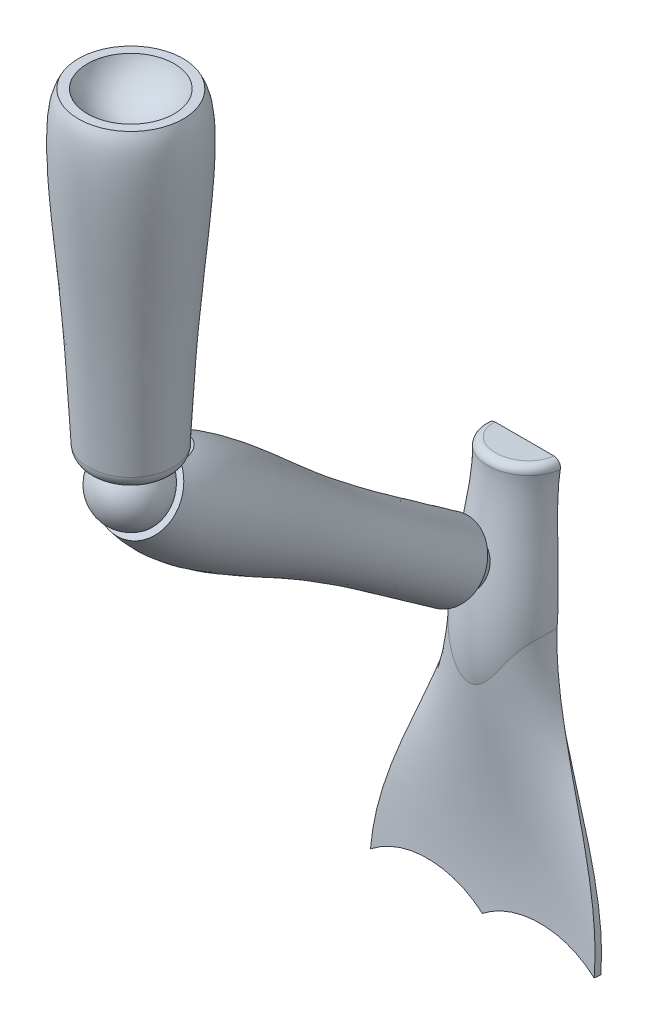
ISO-10303-21;
HEADER;
FILE_DESCRIPTION(('STEP AP214'),'2;1');
FILE_NAME('part.step','',(''),(''),'','','');
FILE_SCHEMA(('AUTOMOTIVE_DESIGN { 1 0 10303 214 1 1 1 1 }'));
ENDSEC;
DATA;
#1=APPLICATION_CONTEXT('core data for automotive mechanical design processes');
#2=APPLICATION_PROTOCOL_DEFINITION('international standard','automotive_design',2000,#1);
#3=PRODUCT_CONTEXT('',#1,'mechanical');
#4=PRODUCT('Part','Part','',(#3));
#5=PRODUCT_RELATED_PRODUCT_CATEGORY('part','',(#4));
#6=PRODUCT_DEFINITION_FORMATION('','',#4);
#7=PRODUCT_DEFINITION_CONTEXT('part definition',#1,'design');
#8=PRODUCT_DEFINITION('design','',#6,#7);
#9=PRODUCT_DEFINITION_SHAPE('','',#8);
#10=(LENGTH_UNIT() NAMED_UNIT(*) SI_UNIT(.MILLI.,.METRE.));
#11=(NAMED_UNIT(*) PLANE_ANGLE_UNIT() SI_UNIT($,.RADIAN.));
#12=(NAMED_UNIT(*) SI_UNIT($,.STERADIAN.) SOLID_ANGLE_UNIT());
#13=UNCERTAINTY_MEASURE_WITH_UNIT(LENGTH_MEASURE(1.E-05),#10,'distance_accuracy_value','');
#14=(GEOMETRIC_REPRESENTATION_CONTEXT(3) GLOBAL_UNCERTAINTY_ASSIGNED_CONTEXT((#13)) GLOBAL_UNIT_ASSIGNED_CONTEXT((#10,
#11,#12)) REPRESENTATION_CONTEXT('',''));
#15=CARTESIAN_POINT('',(0.,0.,0.));
#16=DIRECTION('',(0.,0.,1.));
#17=DIRECTION('',(1.,0.,0.));
#18=AXIS2_PLACEMENT_3D('',#15,#16,#17);
#19=CARTESIAN_POINT('',(0.0830227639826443,-27.5215206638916,102.18652835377));
#20=DIRECTION('',(0.,1.,0.));
#21=DIRECTION('',(1.,0.,0.));
#22=AXIS2_PLACEMENT_3D('',#19,#20,#21);
#23=SPHERICAL_SURFACE('',#22,36.195);
#24=CARTESIAN_POINT('',(0.0830227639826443,-29.2468901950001,100.036748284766));
#25=DIRECTION('',(0.,0.62592095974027,0.779886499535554));
#26=DIRECTION('',(0.,-0.779886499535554,0.62592095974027));
#27=AXIS2_PLACEMENT_3D('',#24,#25,#26);
#28=CIRCLE('',#27,36.0898818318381);
#29=CARTESIAN_POINT('',(-14.3284501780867,-3.44232066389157,79.3265283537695));
#30=VERTEX_POINT('',#29);
#31=CARTESIAN_POINT('',(14.494495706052,-3.44232066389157,79.3265283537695));
#32=VERTEX_POINT('',#31);
#33=EDGE_CURVE('E11',#30,#32,#28,.F.);
#34=ORIENTED_EDGE('',*,*,#33,.T.);
#35=CARTESIAN_POINT('',(0.0830227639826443,-3.44232066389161,102.18652835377));
#36=DIRECTION('',(0.,1.,0.));
#37=DIRECTION('',(0.,0.,1.));
#38=AXIS2_PLACEMENT_3D('',#35,#36,#37);
#39=CIRCLE('',#38,27.0235111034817);
#40=EDGE_CURVE('E407',#32,#30,#39,.F.);
#41=ORIENTED_EDGE('',*,*,#40,.T.);
#42=EDGE_LOOP('',(#34,#41));
#43=FACE_BOUND('',#42,.T.);
#44=CARTESIAN_POINT('',(0.0830227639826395,-33.7618977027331,93.3469157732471));
#45=DIRECTION('',(0.,-0.576723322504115,-0.816939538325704));
#46=DIRECTION('',(0.,0.816939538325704,-0.576723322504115));
#47=AXIS2_PLACEMENT_3D('',#44,#45,#46);
#48=CIRCLE('',#47,34.539788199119);
#49=CARTESIAN_POINT('',(13.1451586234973,-7.64055041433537,74.9063954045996));
#50=VERTEX_POINT('',#49);
#51=CARTESIAN_POINT('',(-12.9791130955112,-7.64055041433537,74.9063954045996));
#52=VERTEX_POINT('',#51);
#53=EDGE_CURVE('E468',#50,#52,#48,.T.);
#54=ORIENTED_EDGE('',*,*,#53,.F.);
#55=CARTESIAN_POINT('',(0.0830227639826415,-5.29665458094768,100.120512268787));
#56=DIRECTION('',(0.,-0.995707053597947,0.0925605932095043));
#57=DIRECTION('',(0.,-0.0925605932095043,-0.995707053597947));
#58=AXIS2_PLACEMENT_3D('',#55,#56,#57);
#59=CIRCLE('',#58,28.4932435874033);
#60=EDGE_CURVE('E56',#50,#52,#59,.F.);
#61=ORIENTED_EDGE('',*,*,#60,.T.);
#62=EDGE_LOOP('',(#54,#61));
#63=FACE_BOUND('',#62,.T.);
#64=ADVANCED_FACE('F34',(#43,#63),#23,.T.);
#65=CARTESIAN_POINT('',(0.0830227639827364,-3.44232066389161,102.18652835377));
#66=DIRECTION('',(0.,1.,0.));
#67=DIRECTION('',(0.,0.,1.));
#68=AXIS2_PLACEMENT_3D('',#65,#66,#67);
#69=PLANE('',#68);
#70=ORIENTED_EDGE('',*,*,#40,.F.);
#71=DIRECTION('',(1.,0.,0.));
#72=VECTOR('',#71,1.);
#73=CARTESIAN_POINT('',(-210.094522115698,-3.44232066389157,79.3265283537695));
#74=LINE('',#73,#72);
#75=CARTESIAN_POINT('',(19.3413333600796,-3.44232066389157,79.3265283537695));
#76=VERTEX_POINT('',#75);
#77=EDGE_CURVE('E457',#32,#76,#74,.T.);
#78=ORIENTED_EDGE('',*,*,#77,.T.);
#79=CARTESIAN_POINT('',(0.0830227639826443,-3.44232066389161,102.18652835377));
#80=DIRECTION('',(0.,1.,0.));
#81=DIRECTION('',(0.,0.,1.));
#82=AXIS2_PLACEMENT_3D('',#79,#80,#81);
#83=CIRCLE('',#82,29.8908368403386);
#84=CARTESIAN_POINT('',(-19.1752878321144,-3.44232066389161,79.3265283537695));
#85=VERTEX_POINT('',#84);
#86=EDGE_CURVE('E416',#76,#85,#83,.F.);
#87=ORIENTED_EDGE('',*,*,#86,.T.);
#88=EDGE_CURVE('E438',#85,#30,#74,.T.);
#89=ORIENTED_EDGE('',*,*,#88,.T.);
#90=EDGE_LOOP('',(#70,#78,#87,#89));
#91=FACE_BOUND('',#90,.T.);
#92=ADVANCED_FACE('F424',(#91),#69,.F.);
#93=CARTESIAN_POINT('',(-210.094522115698,25.1326793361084,56.3928175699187));
#94=DIRECTION('',(0.,0.62592095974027,0.779886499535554));
#95=DIRECTION('',(0.,-0.779886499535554,0.62592095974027));
#96=AXIS2_PLACEMENT_3D('',#93,#94,#95);
#97=PLANE('',#96);
#98=ORIENTED_EDGE('',*,*,#33,.F.);
#99=ORIENTED_EDGE('',*,*,#88,.F.);
#100=CARTESIAN_POINT('',(29.1414359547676,11.0715502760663,67.67799227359));
#101=CARTESIAN_POINT('',(29.3863227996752,10.7929578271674,67.9015848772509));
#102=CARTESIAN_POINT('',(29.6193641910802,10.5078747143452,68.130386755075));
#103=CARTESIAN_POINT('',(30.0590073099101,9.92507556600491,68.5981294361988));
#104=CARTESIAN_POINT('',(30.2655732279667,9.62734313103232,68.8370834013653));
#105=CARTESIAN_POINT('',(30.6506379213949,9.01750350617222,69.326528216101));
#106=CARTESIAN_POINT('',(30.828855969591,8.70528787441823,69.5771060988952));
#107=CARTESIAN_POINT('',(31.1512535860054,8.07042045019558,70.0866377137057));
#108=CARTESIAN_POINT('',(31.2954482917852,7.74777337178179,70.345587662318));
#109=CARTESIAN_POINT('',(31.5202473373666,7.16096407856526,70.8165488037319));
#110=CARTESIAN_POINT('',(31.6078309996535,6.89842389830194,71.0272581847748));
#111=CARTESIAN_POINT('',(31.7570832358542,6.36896643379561,71.4521899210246));
#112=CARTESIAN_POINT('',(31.8187623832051,6.10205098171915,71.6664108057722));
#113=CARTESIAN_POINT('',(31.9139899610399,5.56602578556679,72.0966136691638));
#114=CARTESIAN_POINT('',(31.9476277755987,5.29692579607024,72.3125878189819));
#115=CARTESIAN_POINT('',(31.9850107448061,4.75745921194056,72.7455526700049));
#116=CARTESIAN_POINT('',(31.9887619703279,4.4870928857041,72.9625431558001));
#117=CARTESIAN_POINT('',(31.966613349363,3.99592275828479,73.3567462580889));
#118=CARTESIAN_POINT('',(31.9459379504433,3.77497244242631,73.5340764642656));
#119=CARTESIAN_POINT('',(31.8822356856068,3.33505413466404,73.8871459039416));
#120=CARTESIAN_POINT('',(31.8392133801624,3.1160857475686,74.0628854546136));
#121=CARTESIAN_POINT('',(31.7300282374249,2.68160932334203,74.4115873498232));
#122=CARTESIAN_POINT('',(31.6638596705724,2.46610215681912,74.5845489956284));
#123=CARTESIAN_POINT('',(31.5078775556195,2.04033079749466,74.9262643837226));
#124=CARTESIAN_POINT('',(31.4180637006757,1.83006667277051,75.0950180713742));
#125=CARTESIAN_POINT('',(31.2140606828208,1.41544927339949,75.4277815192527));
#126=CARTESIAN_POINT('',(31.0997344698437,1.21113688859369,75.5917584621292));
#127=CARTESIAN_POINT('',(30.8473196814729,0.811627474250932,75.9123965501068));
#128=CARTESIAN_POINT('',(30.7092311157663,0.61643044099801,76.0690576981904));
#129=CARTESIAN_POINT('',(30.4101878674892,0.237138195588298,76.3734698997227));
#130=CARTESIAN_POINT('',(30.2492457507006,0.0530369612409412,76.5212257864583));
#131=CARTESIAN_POINT('',(29.905771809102,-0.302465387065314,76.80654470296));
#132=CARTESIAN_POINT('',(29.7232415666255,-0.473867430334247,76.9441084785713));
#133=CARTESIAN_POINT('',(29.3572189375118,-0.786491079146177,77.1950138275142));
#134=CARTESIAN_POINT('',(29.1755632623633,-0.929025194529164,77.3094087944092));
#135=CARTESIAN_POINT('',(28.7977451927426,-1.20183472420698,77.5283601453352));
#136=CARTESIAN_POINT('',(28.6015842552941,-1.33211136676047,77.6329175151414));
#137=CARTESIAN_POINT('',(28.1964281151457,-1.57996540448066,77.8318400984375));
#138=CARTESIAN_POINT('',(27.9874295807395,-1.69753948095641,77.9262026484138));
#139=CARTESIAN_POINT('',(27.5584218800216,-1.91978251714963,78.1045703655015));
#140=CARTESIAN_POINT('',(27.338410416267,-2.02444876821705,78.1885733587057));
#141=CARTESIAN_POINT('',(26.8154473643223,-2.25318427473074,78.3721517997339));
#142=CARTESIAN_POINT('',(26.5089623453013,-2.37235632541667,78.4677968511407));
#143=CARTESIAN_POINT('',(25.8835961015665,-2.58890488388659,78.6415942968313));
#144=CARTESIAN_POINT('',(25.5647109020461,-2.68627433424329,78.7197410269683));
#145=CARTESIAN_POINT('',(24.9178450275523,-2.86064573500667,78.859687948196));
#146=CARTESIAN_POINT('',(24.5898610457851,-2.93764017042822,78.9214821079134));
#147=CARTESIAN_POINT('',(23.9277599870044,-3.07296150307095,79.0300882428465));
#148=CARTESIAN_POINT('',(23.5936433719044,-3.1312898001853,79.0769013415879));
#149=CARTESIAN_POINT('',(22.53782529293,-3.28827091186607,79.2028911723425));
#150=CARTESIAN_POINT('',(21.8086827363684,-3.3570437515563,79.2580868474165));
#151=CARTESIAN_POINT('',(20.7116250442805,-3.41707127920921,79.3062637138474));
#152=CARTESIAN_POINT('',(20.3450089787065,-3.42988288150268,79.3165460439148));
#153=CARTESIAN_POINT('',(19.6113838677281,-3.44330770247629,79.3273205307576));
#154=CARTESIAN_POINT('',(19.2443748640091,-3.44392210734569,79.3278136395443));
#155=CARTESIAN_POINT('',(18.5073530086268,-3.43497070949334,79.3206294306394));
#156=CARTESIAN_POINT('',(18.1373424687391,-3.42531432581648,79.3128794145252));
#157=CARTESIAN_POINT('',(17.3978439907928,-3.39761726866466,79.2906503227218));
#158=CARTESIAN_POINT('',(17.0283560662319,-3.37957638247,79.276171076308));
#159=CARTESIAN_POINT('',(16.2902787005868,-3.33688824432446,79.2419104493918));
#160=CARTESIAN_POINT('',(15.9216888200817,-3.31224548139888,79.2221326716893));
#161=CARTESIAN_POINT('',(15.1851112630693,-3.25793907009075,79.1785474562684));
#162=CARTESIAN_POINT('',(14.8171236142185,-3.22827519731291,79.1547398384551));
#163=CARTESIAN_POINT('',(13.7411791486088,-3.13629644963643,79.0809195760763));
#164=CARTESIAN_POINT('',(13.0339112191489,-3.06918018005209,79.0270534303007));
#165=CARTESIAN_POINT('',(11.620014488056,-2.9308845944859,78.9160602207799));
#166=CARTESIAN_POINT('',(10.9133857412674,-2.85970495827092,78.8589329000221));
#167=CARTESIAN_POINT('',(9.49947576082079,-2.72080832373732,78.7474573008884));
#168=CARTESIAN_POINT('',(8.79219447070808,-2.65309166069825,78.6931092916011));
#169=CARTESIAN_POINT('',(7.37621269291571,-2.5273499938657,78.5921916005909));
#170=CARTESIAN_POINT('',(6.66751228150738,-2.46932448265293,78.5456215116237));
#171=CARTESIAN_POINT('',(5.25537448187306,-2.36836469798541,78.4645932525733));
#172=CARTESIAN_POINT('',(4.55195445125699,-2.32528670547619,78.4300197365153));
#173=CARTESIAN_POINT('',(3.14366496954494,-2.25685297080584,78.3750962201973));
#174=CARTESIAN_POINT('',(2.438795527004,-2.2314971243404,78.3547461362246));
#175=CARTESIAN_POINT('',(1.02850778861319,-2.20048445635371,78.3298560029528));
#176=CARTESIAN_POINT('',(0.323089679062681,-2.19482260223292,78.3253119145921));
#177=CARTESIAN_POINT('',(-1.08753422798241,-2.20362935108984,78.3323800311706));
#178=CARTESIAN_POINT('',(-1.7927400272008,-2.21809778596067,78.3439921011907));
#179=CARTESIAN_POINT('',(-3.03761593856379,-2.2604245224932,78.3779626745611));
#180=CARTESIAN_POINT('',(-3.5775149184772,-2.28437060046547,78.3971813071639));
#181=CARTESIAN_POINT('',(-4.65640849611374,-2.34229237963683,78.4436681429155));
#182=CARTESIAN_POINT('',(-5.19540311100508,-2.3762678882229,78.4709361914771));
#183=CARTESIAN_POINT('',(-6.27256761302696,-2.45267243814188,78.5322569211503));
#184=CARTESIAN_POINT('',(-6.81073717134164,-2.49510425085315,78.5663118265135));
#185=CARTESIAN_POINT('',(-7.88617309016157,-2.58635534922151,78.6395480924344));
#186=CARTESIAN_POINT('',(-8.42343944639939,-2.6351746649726,78.6787294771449));
#187=CARTESIAN_POINT('',(-9.50023189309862,-2.73697641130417,78.7604334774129));
#188=CARTESIAN_POINT('',(-10.0397546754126,-2.78997973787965,78.8029728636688));
#189=CARTESIAN_POINT('',(-11.1186578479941,-2.8969429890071,78.888819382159));
#190=CARTESIAN_POINT('',(-11.6580382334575,-2.9509029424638,78.9321265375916));
#191=CARTESIAN_POINT('',(-12.7370241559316,-3.05632008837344,79.0167321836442));
#192=CARTESIAN_POINT('',(-13.2766295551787,-3.10777812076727,79.0580313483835));
#193=CARTESIAN_POINT('',(-14.3567721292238,-3.20426598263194,79.1354705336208));
#194=CARTESIAN_POINT('',(-14.8973092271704,-3.24929631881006,79.1716109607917));
#195=CARTESIAN_POINT('',(-15.9244569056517,-3.3243602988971,79.2318557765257));
#196=CARTESIAN_POINT('',(-16.4109358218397,-3.35545597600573,79.2568125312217));
#197=CARTESIAN_POINT('',(-17.3850723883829,-3.40507050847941,79.2966321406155));
#198=CARTESIAN_POINT('',(-17.8727301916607,-3.42358763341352,79.3114936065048));
#199=CARTESIAN_POINT('',(-18.8482330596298,-3.44378286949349,79.3277018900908));
#200=CARTESIAN_POINT('',(-19.3360775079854,-3.44547693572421,79.3290615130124));
#201=CARTESIAN_POINT('',(-20.3111480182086,-3.42729011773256,79.314465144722));
#202=CARTESIAN_POINT('',(-20.7983741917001,-3.40741393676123,79.2985129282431));
#203=CARTESIAN_POINT('',(-21.6755693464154,-3.34726725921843,79.2502404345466));
#204=CARTESIAN_POINT('',(-22.0660564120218,-3.31170516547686,79.221699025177));
#205=CARTESIAN_POINT('',(-22.8432177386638,-3.22017313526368,79.1482372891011));
#206=CARTESIAN_POINT('',(-23.2298916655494,-3.16420142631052,79.1033155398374));
#207=CARTESIAN_POINT('',(-23.9959211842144,-3.02898322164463,78.9947921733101));
#208=CARTESIAN_POINT('',(-24.3752877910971,-2.94977525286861,78.9312214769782));
#209=CARTESIAN_POINT('',(-25.1234533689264,-2.76526320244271,78.783135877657));
#210=CARTESIAN_POINT('',(-25.4922569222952,-2.65997063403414,78.6986302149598));
#211=CARTESIAN_POINT('',(-26.1102514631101,-2.45551305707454,78.5345367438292));
#212=CARTESIAN_POINT('',(-26.3632595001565,-2.3633409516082,78.4605612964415));
#213=CARTESIAN_POINT('',(-26.8594152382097,-2.16410139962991,78.3006557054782));
#214=CARTESIAN_POINT('',(-27.1025656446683,-2.05703807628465,78.214728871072));
#215=CARTESIAN_POINT('',(-27.5767622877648,-1.82777612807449,78.0307279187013));
#216=CARTESIAN_POINT('',(-27.8078125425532,-1.70558257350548,77.9326578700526));
#217=CARTESIAN_POINT('',(-28.2556070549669,-1.44613259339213,77.7244286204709));
#218=CARTESIAN_POINT('',(-28.4723511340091,-1.30887597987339,77.6142692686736));
#219=CARTESIAN_POINT('',(-28.8905519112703,-1.01892395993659,77.3815597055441));
#220=CARTESIAN_POINT('',(-29.091907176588,-0.866139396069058,77.2589379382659));
#221=CARTESIAN_POINT('',(-29.475753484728,-0.546763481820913,77.002613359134));
#222=CARTESIAN_POINT('',(-29.6582443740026,-0.380172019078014,76.8689104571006));
#223=CARTESIAN_POINT('',(-30.002586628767,-0.0344834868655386,76.5914679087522));
#224=CARTESIAN_POINT('',(-30.1644379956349,0.144613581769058,76.4477282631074));
#225=CARTESIAN_POINT('',(-30.4661534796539,0.513725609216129,76.1514864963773));
#226=CARTESIAN_POINT('',(-30.6060187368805,0.703740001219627,75.9989848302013));
#227=CARTESIAN_POINT('',(-30.8517829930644,1.07606212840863,75.7001667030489));
#228=CARTESIAN_POINT('',(-30.9595740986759,1.25761338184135,75.5544573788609));
#229=CARTESIAN_POINT('',(-31.1558387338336,1.62702396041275,75.2579760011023));
#230=CARTESIAN_POINT('',(-31.2443057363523,1.81488539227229,75.1072022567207));
#231=CARTESIAN_POINT('',(-31.4018454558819,2.19540684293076,74.8018035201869));
#232=CARTESIAN_POINT('',(-31.470924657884,2.38806523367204,74.6471798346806));
#233=CARTESIAN_POINT('',(-31.5900154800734,2.7769905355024,74.335036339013));
#234=CARTESIAN_POINT('',(-31.6400199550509,2.97325877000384,74.1775154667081));
#235=CARTESIAN_POINT('',(-31.7238835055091,3.38020370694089,73.8509097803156));
#236=CARTESIAN_POINT('',(-31.7565686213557,3.59102771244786,73.6817067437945));
#237=CARTESIAN_POINT('',(-31.8017293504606,4.01401245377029,73.3422278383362));
#238=CARTESIAN_POINT('',(-31.8141969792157,4.22617368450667,73.1719515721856));
#239=CARTESIAN_POINT('',(-31.8225357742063,4.86292723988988,72.6609061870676));
#240=CARTESIAN_POINT('',(-31.7893722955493,5.28793958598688,72.3197999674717));
#241=CARTESIAN_POINT('',(-31.6716295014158,6.01858171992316,71.7334015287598));
#242=CARTESIAN_POINT('',(-31.6030456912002,6.32593772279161,71.486723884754));
#243=CARTESIAN_POINT('',(-31.4316124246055,6.93493873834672,70.9979521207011));
#244=CARTESIAN_POINT('',(-31.3287483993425,7.23658126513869,70.7558599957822));
#245=CARTESIAN_POINT('',(-31.0916567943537,7.83277996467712,70.2773631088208));
#246=CARTESIAN_POINT('',(-30.9573748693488,8.12732287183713,70.0409689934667));
#247=CARTESIAN_POINT('',(-30.6604586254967,8.70759983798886,69.5752505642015));
#248=CARTESIAN_POINT('',(-30.4978185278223,8.9933320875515,69.3459277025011));
#249=CARTESIAN_POINT('',(-30.1267288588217,9.58730489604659,68.8692172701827));
#250=CARTESIAN_POINT('',(-29.9151637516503,9.89436348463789,68.6227783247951));
#251=CARTESIAN_POINT('',(-29.5771990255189,10.3442258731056,68.2617279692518));
#252=CARTESIAN_POINT('',(-29.4614691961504,10.4919837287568,68.1431405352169));
#253=CARTESIAN_POINT('',(-29.2233392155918,10.7842339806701,67.9085864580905));
#254=CARTESIAN_POINT('',(-29.1009378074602,10.9287257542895,67.7926203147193));
#255=CARTESIAN_POINT('',(-28.9753904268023,11.0715502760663,67.6779922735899));
#256=B_SPLINE_CURVE_WITH_KNOTS('',3,(#100,#101,#102,#103,#104,#105,#106,#107,#108,#109,#110,
#111,#112,#113,#114,#115,#116,#117,#118,#119,#120,#121,#122,#123,#124,#125,#126,#127,#128,#129,
#130,#131,#132,#133,#134,#135,#136,#137,#138,#139,#140,#141,#142,#143,#144,#145,#146,#147,#148,
#149,#150,#151,#152,#153,#154,#155,#156,#157,#158,#159,#160,#161,#162,#163,#164,#165,#166,#167,
#168,#169,#170,#171,#172,#173,#174,#175,#176,#177,#178,#179,#180,#181,#182,#183,#184,#185,#186,
#187,#188,#189,#190,#191,#192,#193,#194,#195,#196,#197,#198,#199,#200,#201,#202,#203,#204,#205,
#206,#207,#208,#209,#210,#211,#212,#213,#214,#215,#216,#217,#218,#219,#220,#221,#222,#223,#224,
#225,#226,#227,#228,#229,#230,#231,#232,#233,#234,#235,#236,#237,#238,#239,#240,#241,#242,#243,
#244,#245,#246,#247,#248,#249,#250,#251,#252,#253,#254,#255),.UNSPECIFIED.,.F.,.F.,(4,2,2,2,2,2,
2,2,2,2,2,2,2,2,2,2,2,2,2,2,2,2,2,2,2,2,2,2,2,2,2,2,2,2,2,2,2,2,2,2,2,2,2,2,2,2,2,2,2,2,2,2,2,2,
2,2,2,2,2,2,2,2,2,2,2,2,2,2,2,2,2,2,2,2,2,2,2,4),(0.,1.29931364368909,2.60036653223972,
3.9135940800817,5.22623624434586,6.26886137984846,7.31106053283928,8.34992474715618,
9.38857793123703,10.2399507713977,11.09114993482,11.9425599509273,12.7939810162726,
13.6502927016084,14.5066040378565,15.3624463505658,16.2182259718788,16.9903864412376,
17.7624694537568,18.5347536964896,19.307199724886,20.3330233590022,21.3591785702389,
22.3857117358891,23.4121678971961,25.6092986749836,26.7100952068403,27.8107846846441,
28.9212625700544,30.0317686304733,31.1415214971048,32.2513239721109,34.3886727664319,
36.5261902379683,38.6639142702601,40.8015263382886,42.9179756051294,45.0344124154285,
47.1503083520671,49.2661866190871,50.8883394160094,52.5104610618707,54.1331152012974,
55.755776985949,57.3871292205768,59.018530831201,60.6493809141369,62.280102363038,
63.744246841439,65.2085927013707,66.6715496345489,68.1341876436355,69.3128737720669,
70.4916622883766,71.6685072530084,72.8448337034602,73.6818552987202,74.5186455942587,
75.3551562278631,76.1916773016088,77.0333065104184,77.8749425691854,78.7165785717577,
79.5581709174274,80.3269196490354,81.0959276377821,81.864678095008,82.6337162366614,
83.449770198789,84.2661463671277,85.8983197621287,87.0969880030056,88.2961663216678,
89.4974344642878,90.6989476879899,92.0384015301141,92.7043183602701,93.3703610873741),.UNSPECIFIED.);
#257=CARTESIAN_POINT('',(-28.9764451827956,11.0703502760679,67.6789553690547));
#258=VERTEX_POINT('',#257);
#259=EDGE_CURVE('E409',#85,#258,#256,.T.);
#260=ORIENTED_EDGE('',*,*,#259,.T.);
#261=CARTESIAN_POINT('',(29.1424907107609,11.0703502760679,67.6789553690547));
#262=CARTESIAN_POINT('',(28.6860927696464,11.5896109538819,67.2622073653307));
#263=CARTESIAN_POINT('',(28.2163169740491,12.1018146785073,66.8511231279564));
#264=CARTESIAN_POINT('',(27.2482702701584,13.1111010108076,66.0410905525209));
#265=CARTESIAN_POINT('',(26.749946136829,13.6081525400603,65.642167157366));
#266=CARTESIAN_POINT('',(25.7244823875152,14.5844278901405,64.8586285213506));
#267=CARTESIAN_POINT('',(25.1973241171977,15.0636398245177,64.474022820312));
#268=CARTESIAN_POINT('',(24.1070738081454,16.0073345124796,63.7166327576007));
#269=CARTESIAN_POINT('',(23.5436188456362,16.4715627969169,63.3440526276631));
#270=CARTESIAN_POINT('',(22.3864265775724,17.3760062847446,62.6181647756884));
#271=CARTESIAN_POINT('',(21.7927065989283,17.8162349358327,62.264846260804));
#272=CARTESIAN_POINT('',(20.5745251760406,18.6697062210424,61.5798676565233));
#273=CARTESIAN_POINT('',(19.9500750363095,19.0829586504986,61.2481997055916));
#274=CARTESIAN_POINT('',(18.584062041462,19.9327628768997,60.5661642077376));
#275=CARTESIAN_POINT('',(17.838039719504,20.3649799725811,60.2192756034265));
#276=CARTESIAN_POINT('',(16.3066367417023,21.1849257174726,59.5612039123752));
#277=CARTESIAN_POINT('',(15.5212545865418,21.572652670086,59.2500221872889));
#278=CARTESIAN_POINT('',(13.9162837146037,22.2960128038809,58.66946813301));
#279=CARTESIAN_POINT('',(13.0968544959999,22.6318603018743,58.3999237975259));
#280=CARTESIAN_POINT('',(11.4238564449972,23.2471670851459,57.9060911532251));
#281=CARTESIAN_POINT('',(10.5702940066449,23.5266368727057,57.6817944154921));
#282=CARTESIAN_POINT('',(8.96763049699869,23.9849023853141,57.3139998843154));
#283=CARTESIAN_POINT('',(8.22269689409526,24.1725750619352,57.163377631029));
#284=CARTESIAN_POINT('',(6.71567933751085,24.4999738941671,56.9006140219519));
#285=CARTESIAN_POINT('',(5.95359704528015,24.6397046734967,56.7884689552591));
#286=CARTESIAN_POINT('',(4.4167938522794,24.8685524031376,56.6048004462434));
#287=CARTESIAN_POINT('',(3.64206985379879,24.9576567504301,56.5332871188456));
#288=CARTESIAN_POINT('',(2.08559340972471,25.083356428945,56.4324031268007));
#289=CARTESIAN_POINT('',(1.30384076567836,25.1199502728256,56.4030336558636));
#290=CARTESIAN_POINT('',(-0.261781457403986,25.1398480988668,56.3870640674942));
#291=CARTESIAN_POINT('',(-1.04565246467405,25.1230840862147,56.4005185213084));
#292=CARTESIAN_POINT('',(-2.60847730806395,25.0364846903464,56.4700214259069));
#293=CARTESIAN_POINT('',(-3.38743151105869,24.9666533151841,56.526066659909));
#294=CARTESIAN_POINT('',(-4.93478132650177,24.7754042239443,56.6795592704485));
#295=CARTESIAN_POINT('',(-5.70317729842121,24.6539882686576,56.7770052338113));
#296=CARTESIAN_POINT('',(-7.2246606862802,24.3619434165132,57.0113944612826));
#297=CARTESIAN_POINT('',(-7.97774253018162,24.1912969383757,57.1483518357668));
#298=CARTESIAN_POINT('',(-9.45624459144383,23.8059906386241,57.4575907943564));
#299=CARTESIAN_POINT('',(-10.1818727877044,23.591814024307,57.6294845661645));
#300=CARTESIAN_POINT('',(-11.6107977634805,23.1217420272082,58.0067547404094));
#301=CARTESIAN_POINT('',(-12.3140860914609,22.8658310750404,58.2121436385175));
#302=CARTESIAN_POINT('',(-13.6963774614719,22.3157282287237,58.6536449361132));
#303=CARTESIAN_POINT('',(-14.3753559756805,22.0214989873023,58.8897873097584));
#304=CARTESIAN_POINT('',(-15.7069079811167,21.3985218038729,59.3897760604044));
#305=CARTESIAN_POINT('',(-16.3594752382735,21.0697657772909,59.6536289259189));
#306=CARTESIAN_POINT('',(-17.5037000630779,20.4531949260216,60.1484760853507));
#307=CARTESIAN_POINT('',(-18.0005093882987,20.1711609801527,60.3748307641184));
#308=CARTESIAN_POINT('',(-18.9766190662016,19.5894043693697,60.8417367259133));
#309=CARTESIAN_POINT('',(-19.4559221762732,19.289684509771,61.0822857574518));
#310=CARTESIAN_POINT('',(-20.8669713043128,18.3666313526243,61.8231093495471));
#311=CARTESIAN_POINT('',(-21.7727258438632,17.7189311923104,62.3429402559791));
#312=CARTESIAN_POINT('',(-23.5162159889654,16.3690299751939,63.4263433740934));
#313=CARTESIAN_POINT('',(-24.3538686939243,15.6667644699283,63.9899673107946));
#314=CARTESIAN_POINT('',(-25.9623160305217,14.2173987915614,65.1531985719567));
#315=CARTESIAN_POINT('',(-26.7331240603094,13.4703076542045,65.7527986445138));
#316=CARTESIAN_POINT('',(-27.7306288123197,12.4363539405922,66.5826287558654));
#317=CARTESIAN_POINT('',(-27.9855253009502,12.1657725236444,66.7997918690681));
#318=CARTESIAN_POINT('',(-28.4870054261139,11.620917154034,67.2370816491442));
#319=CARTESIAN_POINT('',(-28.7336070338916,11.3466532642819,67.4572002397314));
#320=CARTESIAN_POINT('',(-28.9764451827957,11.070350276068,67.6789553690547));
#321=B_SPLINE_CURVE_WITH_KNOTS('',3,(#261,#262,#263,#264,#265,#266,#267,#268,#269,#270,#271,
#272,#273,#274,#275,#276,#277,#278,#279,#280,#281,#282,#283,#284,#285,#286,#287,#288,#289,#290,
#291,#292,#293,#294,#295,#296,#297,#298,#299,#300,#301,#302,#303,#304,#305,#306,#307,#308,#309,
#310,#311,#312,#313,#314,#315,#316,#317,#318,#319,#320),.UNSPECIFIED.,.F.,.F.,(4,2,2,2,2,2,2,2,
2,2,2,2,2,2,2,2,2,2,2,2,2,2,2,2,2,2,2,2,2,4),(0.,2.42165777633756,4.84798747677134,
7.27590590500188,9.73376095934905,12.1902243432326,14.6457907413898,17.4314246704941,
20.2171647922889,22.991069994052,25.7644579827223,28.1105441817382,30.4564040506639,
32.8028476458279,35.149357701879,37.4988591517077,39.8481831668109,42.1974269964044,
44.5475108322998,46.8728075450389,49.1989737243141,51.5274243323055,53.8564213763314,
55.6992089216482,57.5417049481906,61.2235295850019,64.9097710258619,68.5952718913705,
69.8867580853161,71.1752376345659),.UNSPECIFIED.);
#322=CARTESIAN_POINT('',(29.1424907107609,11.0703502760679,67.6789553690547));
#323=VERTEX_POINT('',#322);
#324=EDGE_CURVE('E432',#323,#258,#321,.T.);
#325=ORIENTED_EDGE('',*,*,#324,.F.);
#326=EDGE_CURVE('E49',#323,#76,#256,.T.);
#327=ORIENTED_EDGE('',*,*,#326,.T.);
#328=ORIENTED_EDGE('',*,*,#77,.F.);
#329=EDGE_LOOP('',(#98,#99,#260,#325,#327,#328));
#330=FACE_BOUND('',#329,.T.);
#331=ADVANCED_FACE('F418',(#330),#97,.F.);
#332=CARTESIAN_POINT('',(0.0830227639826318,338.238479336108,102.18652835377));
#333=DIRECTION('',(0.,-1.,0.));
#334=DIRECTION('',(0.,0.,-1.));
#335=AXIS2_PLACEMENT_3D('',#332,#333,#334);
#336=PLANE('',#335);
#337=CARTESIAN_POINT('',(0.0830227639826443,338.238479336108,102.18652835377));
#338=DIRECTION('',(0.,-1.,0.));
#339=DIRECTION('',(0.,0.,-1.));
#340=AXIS2_PLACEMENT_3D('',#337,#338,#339);
#341=CIRCLE('',#340,46.3135551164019);
#342=CARTESIAN_POINT('',(0.0830227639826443,338.238479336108,55.8729732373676));
#343=VERTEX_POINT('',#342);
#344=EDGE_CURVE('E405',#343,#343,#341,.T.);
#345=ORIENTED_EDGE('',*,*,#344,.T.);
#346=EDGE_LOOP('',(#345));
#347=FACE_BOUND('',#346,.T.);
#348=CARTESIAN_POINT('',(0.0830227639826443,338.238479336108,102.18652835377));
#349=DIRECTION('',(0.,1.,0.));
#350=DIRECTION('',(0.,0.,1.));
#351=AXIS2_PLACEMENT_3D('',#348,#349,#350);
#352=CIRCLE('',#351,55.8546);
#353=CARTESIAN_POINT('',(0.0830227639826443,338.238479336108,158.04112835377));
#354=VERTEX_POINT('',#353);
#355=EDGE_CURVE('E437',#354,#354,#352,.T.);
#356=ORIENTED_EDGE('',*,*,#355,.T.);
#357=EDGE_LOOP('',(#356));
#358=FACE_BOUND('',#357,.T.);
#359=ADVANCED_FACE('F423',(#347,#358),#336,.F.);
#360=CARTESIAN_POINT('',(44.5076227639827,-3.44232066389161,102.18652835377));
#361=CARTESIAN_POINT('',(46.9379355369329,47.927488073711,102.18652835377));
#362=CARTESIAN_POINT('',(51.5684794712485,145.803843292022,102.18652835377));
#363=CARTESIAN_POINT('',(69.8185385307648,311.237875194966,102.18652835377));
#364=CARTESIAN_POINT('',(57.1686134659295,335.844005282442,102.18652835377));
#365=CARTESIAN_POINT('',(55.9376227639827,338.238479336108,102.18652835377));
#366=B_SPLINE_CURVE_WITH_KNOTS('',3,(#360,#361,#362,#363,#364,#365),.UNSPECIFIED.,.F.,.F.,(4,1,
1,4),(0.,0.499269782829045,0.951272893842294,1.),.UNSPECIFIED.);
#367=CARTESIAN_POINT('',(0.0830227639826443,748.821561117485,102.18652835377));
#368=DIRECTION('',(0.,1.,0.));
#369=AXIS1_PLACEMENT('',#367,#368);
#370=SURFACE_OF_REVOLUTION('',#366,#369);
#371=CARTESIAN_POINT('',(0.0830227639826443,11.0703502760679,102.18652835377));
#372=DIRECTION('',(0.,1.,0.));
#373=DIRECTION('',(0.,0.,1.));
#374=AXIS2_PLACEMENT_3D('',#371,#372,#373);
#375=CIRCLE('',#374,45.1134710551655);
#376=EDGE_CURVE('E448',#258,#323,#375,.T.);
#377=ORIENTED_EDGE('',*,*,#376,.T.);
#378=ORIENTED_EDGE('',*,*,#324,.T.);
#379=EDGE_LOOP('',(#377,#378));
#380=FACE_BOUND('',#379,.T.);
#381=ORIENTED_EDGE('',*,*,#355,.F.);
#382=EDGE_LOOP('',(#381));
#383=FACE_BOUND('',#382,.T.);
#384=ADVANCED_FACE('F426',(#380,#383),#370,.T.);
#385=CARTESIAN_POINT('',(0.0830227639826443,11.7976793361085,102.18652835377));
#386=DIRECTION('',(0.,1.,0.));
#387=DIRECTION('',(0.,0.,1.));
#388=AXIS2_PLACEMENT_3D('',#385,#386,#387);
#389=TOROIDAL_SURFACE('',#388,29.8908368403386,15.24);
#390=ORIENTED_EDGE('',*,*,#326,.F.);
#391=ORIENTED_EDGE('',*,*,#376,.F.);
#392=ORIENTED_EDGE('',*,*,#259,.F.);
#393=ORIENTED_EDGE('',*,*,#86,.F.);
#394=EDGE_LOOP('',(#390,#391,#392,#393));
#395=FACE_BOUND('',#394,.T.);
#396=ADVANCED_FACE('F36',(#395),#389,.T.);
#397=CARTESIAN_POINT('',(0.0830227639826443,356.221679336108,102.18652835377));
#398=DIRECTION('',(0.,-1.,0.));
#399=DIRECTION('',(-1.,0.,0.));
#400=AXIS2_PLACEMENT_3D('',#397,#398,#399);
#401=SPHERICAL_SURFACE('',#400,49.6824);
#402=ORIENTED_EDGE('',*,*,#344,.F.);
#403=EDGE_LOOP('',(#402));
#404=FACE_BOUND('',#403,.T.);
#405=ADVANCED_FACE('F497',(#404),#401,.F.);
#406=CARTESIAN_POINT('',(0.0830227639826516,-265.710559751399,-235.212768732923));
#407=DIRECTION('',(0.,0.576723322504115,0.816939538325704));
#408=DIRECTION('',(0.,-0.816939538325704,0.576723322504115));
#409=AXIS2_PLACEMENT_3D('',#406,#407,#408);
#410=PLANE('',#409);
#411=CARTESIAN_POINT('',(0.0830227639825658,-265.710559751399,-235.212768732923));
#412=DIRECTION('',(0.,0.576723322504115,0.816939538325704));
#413=DIRECTION('',(0.,-0.816939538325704,0.576723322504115));
#414=AXIS2_PLACEMENT_3D('',#411,#412,#413);
#415=CIRCLE('',#414,37.4904000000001);
#416=CARTESIAN_POINT('',(0.0830227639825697,-296.337949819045,-213.591180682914));
#417=VERTEX_POINT('',#416);
#418=EDGE_CURVE('E465',#417,#417,#415,.T.);
#419=ORIENTED_EDGE('',*,*,#418,.F.);
#420=EDGE_LOOP('',(#419));
#421=FACE_BOUND('',#420,.T.);
#422=CARTESIAN_POINT('',(0.0830227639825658,-265.710559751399,-235.212768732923));
#423=DIRECTION('',(0.,0.576723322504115,0.816939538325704));
#424=DIRECTION('',(0.,-0.816939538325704,0.576723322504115));
#425=AXIS2_PLACEMENT_3D('',#422,#423,#424);
#426=CIRCLE('',#425,25.4845429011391);
#427=CARTESIAN_POINT('',(0.0830227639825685,-286.529890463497,-220.515238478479));
#428=VERTEX_POINT('',#427);
#429=EDGE_CURVE('E224',#428,#428,#426,.F.);
#430=ORIENTED_EDGE('',*,*,#429,.F.);
#431=EDGE_LOOP('',(#430));
#432=FACE_BOUND('',#431,.T.);
#433=ADVANCED_FACE('F499',(#421,#432),#410,.F.);
#434=CARTESIAN_POINT('',(0.0830227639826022,-33.7618977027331,93.3469157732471));
#435=DIRECTION('',(0.,-0.576723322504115,-0.816939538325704));
#436=DIRECTION('',(0.,0.816939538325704,-0.576723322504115));
#437=AXIS2_PLACEMENT_3D('',#434,#435,#436);
#438=PLANE('',#437);
#439=CARTESIAN_POINT('',(0.0830227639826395,-33.7618977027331,93.3469157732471));
#440=DIRECTION('',(0.,0.576723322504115,0.816939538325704));
#441=DIRECTION('',(0.,-0.816939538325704,0.576723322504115));
#442=AXIS2_PLACEMENT_3D('',#439,#440,#441);
#443=CIRCLE('',#442,41.3004);
#444=CARTESIAN_POINT('',(-26.0578545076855,-7.64055041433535,74.9063954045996));
#445=VERTEX_POINT('',#444);
#446=CARTESIAN_POINT('',(26.2239000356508,-7.64055041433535,74.9063954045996));
#447=VERTEX_POINT('',#446);
#448=EDGE_CURVE('E471',#445,#447,#443,.T.);
#449=ORIENTED_EDGE('',*,*,#448,.T.);
#450=DIRECTION('',(-1.,0.,0.));
#451=VECTOR('',#450,1.);
#452=CARTESIAN_POINT('',(0.0830227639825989,-7.64055041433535,74.9063954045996));
#453=LINE('',#452,#451);
#454=EDGE_CURVE('E215',#447,#50,#453,.T.);
#455=ORIENTED_EDGE('',*,*,#454,.T.);
#456=ORIENTED_EDGE('',*,*,#53,.T.);
#457=EDGE_CURVE('E209',#52,#445,#453,.T.);
#458=ORIENTED_EDGE('',*,*,#457,.T.);
#459=EDGE_LOOP('',(#449,#455,#456,#458));
#460=FACE_BOUND('',#459,.T.);
#461=ADVANCED_FACE('F477',(#460),#438,.F.);
#462=CARTESIAN_POINT('',(37.5734227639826,-265.710559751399,-235.212768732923));
#463=CARTESIAN_POINT('',(37.5828062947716,-256.633268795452,-222.354613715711));
#464=CARTESIAN_POINT('',(37.619141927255,-221.48348184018,-172.564272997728));
#465=CARTESIAN_POINT('',(36.9406542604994,-159.489698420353,-84.7489015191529));
#466=CARTESIAN_POINT('',(55.2648438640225,-94.9510983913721,6.67125101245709));
#467=CARTESIAN_POINT('',(50.6091492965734,-52.0667794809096,67.4177031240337));
#468=CARTESIAN_POINT('',(42.9792829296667,-36.9282642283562,88.8616974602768));
#469=CARTESIAN_POINT('',(41.3834227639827,-33.7618977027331,93.3469157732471));
#470=B_SPLINE_CURVE_WITH_KNOTS('',3,(#462,#463,#464,#465,#466,#467,#468,#469),.UNSPECIFIED.,.F.,
.F.,(4,1,1,1,1,4),(0.,0.117019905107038,0.453133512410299,0.796967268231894,0.95753374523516,
1.),.UNSPECIFIED.);
#471=CARTESIAN_POINT('',(0.0830227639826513,3.36041515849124,145.931376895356));
#472=DIRECTION('',(0.,0.576723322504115,0.816939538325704));
#473=AXIS1_PLACEMENT('',#471,#472);
#474=SURFACE_OF_REVOLUTION('',#470,#473);
#475=ORIENTED_EDGE('',*,*,#448,.F.);
#476=CARTESIAN_POINT('',(-26.0578545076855,-7.64055041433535,74.9063954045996));
#477=CARTESIAN_POINT('',(-25.9341811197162,-7.69458228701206,74.3251554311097));
#478=CARTESIAN_POINT('',(-25.8062266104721,-7.74853180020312,73.7448014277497));
#479=CARTESIAN_POINT('',(-25.5407448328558,-7.85623399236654,72.5862108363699));
#480=CARTESIAN_POINT('',(-25.4032166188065,-7.90998665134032,72.0079744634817));
#481=CARTESIAN_POINT('',(-25.116439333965,-8.01768858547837,70.849386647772));
#482=CARTESIAN_POINT('',(-24.9671040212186,-8.07163590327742,70.2690562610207));
#483=CARTESIAN_POINT('',(-24.6565934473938,-8.17923574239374,69.1115667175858));
#484=CARTESIAN_POINT('',(-24.4954184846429,-8.23288827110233,68.5344074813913));
#485=CARTESIAN_POINT('',(-23.9913701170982,-8.39364680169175,66.8050710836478));
#486=CARTESIAN_POINT('',(-23.6288110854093,-8.50023323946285,65.6584830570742));
#487=CARTESIAN_POINT('',(-22.8342599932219,-8.71322054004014,63.3673032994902));
#488=CARTESIAN_POINT('',(-22.4011969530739,-8.81958775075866,62.2230735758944));
#489=CARTESIAN_POINT('',(-21.6946101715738,-8.97678110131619,60.5320890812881));
#490=CARTESIAN_POINT('',(-21.4499204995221,-9.02872313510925,59.9733302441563));
#491=CARTESIAN_POINT('',(-20.9398188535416,-9.13173440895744,58.8652015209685));
#492=CARTESIAN_POINT('',(-20.6744062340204,-9.18280362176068,58.3158319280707));
#493=CARTESIAN_POINT('',(-20.1218283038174,-9.28380479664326,57.2293265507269));
#494=CARTESIAN_POINT('',(-19.8347049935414,-9.33373872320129,56.6921696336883));
#495=CARTESIAN_POINT('',(-19.2366761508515,-9.43236866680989,55.6311724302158));
#496=CARTESIAN_POINT('',(-18.9257738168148,-9.48106484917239,55.107330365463));
#497=CARTESIAN_POINT('',(-18.4275376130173,-9.55500995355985,54.3118767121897));
#498=CARTESIAN_POINT('',(-18.2489523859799,-9.58076635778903,54.0348059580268));
#499=CARTESIAN_POINT('',(-17.8843920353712,-9.63182547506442,53.4855449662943));
#500=CARTESIAN_POINT('',(-17.6984171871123,-9.65712820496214,53.2133545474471));
#501=CARTESIAN_POINT('',(-17.1290762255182,-9.73231592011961,52.4045336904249));
#502=CARTESIAN_POINT('',(-16.7343513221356,-9.78147184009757,51.8757460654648));
#503=CARTESIAN_POINT('',(-15.9145238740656,-9.87738397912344,50.8439852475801));
#504=CARTESIAN_POINT('',(-15.4894928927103,-9.92414543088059,50.3409557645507));
#505=CARTESIAN_POINT('',(-14.6072690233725,-10.0149982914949,49.3636193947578));
#506=CARTESIAN_POINT('',(-14.150078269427,-10.0590898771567,48.8893106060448));
#507=CARTESIAN_POINT('',(-13.1976109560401,-10.1446127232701,47.9693110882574));
#508=CARTESIAN_POINT('',(-12.7019723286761,-10.1860095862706,47.5239903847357));
#509=CARTESIAN_POINT('',(-11.6767671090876,-10.2650625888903,46.6735892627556));
#510=CARTESIAN_POINT('',(-11.1471970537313,-10.3027183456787,46.2685129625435));
#511=CARTESIAN_POINT('',(-10.0553076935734,-10.3736215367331,45.5057822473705));
#512=CARTESIAN_POINT('',(-9.49302191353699,-10.4068733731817,45.1480804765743));
#513=CARTESIAN_POINT('',(-8.33707551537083,-10.4683183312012,44.4870953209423));
#514=CARTESIAN_POINT('',(-7.74342707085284,-10.496513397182,44.1837910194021));
#515=CARTESIAN_POINT('',(-6.68551758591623,-10.5405857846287,43.7096887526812));
#516=CARTESIAN_POINT('',(-6.22754511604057,-10.5577623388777,43.5249144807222));
#517=CARTESIAN_POINT('',(-5.29823376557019,-10.5886760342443,43.1923649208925));
#518=CARTESIAN_POINT('',(-4.82689681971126,-10.6024136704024,43.0445843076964));
#519=CARTESIAN_POINT('',(-3.87377866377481,-10.6261932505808,42.7887789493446));
#520=CARTESIAN_POINT('',(-3.39200494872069,-10.6362377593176,42.680726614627));
#521=CARTESIAN_POINT('',(-2.42085179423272,-10.6524460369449,42.5063684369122));
#522=CARTESIAN_POINT('',(-1.93147220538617,-10.6586097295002,42.4400634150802));
#523=CARTESIAN_POINT('',(-0.947063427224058,-10.6669397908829,42.3504539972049));
#524=CARTESIAN_POINT('',(-0.452020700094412,-10.6690925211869,42.3272963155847));
#525=CARTESIAN_POINT('',(0.538170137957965,-10.669311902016,42.3249363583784));
#526=CARTESIAN_POINT('',(1.03331824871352,-10.6673785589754,42.3457340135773));
#527=CARTESIAN_POINT('',(2.01989317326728,-10.6594677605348,42.4308332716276));
#528=CARTESIAN_POINT('',(2.51131935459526,-10.6534896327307,42.4951421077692));
#529=CARTESIAN_POINT('',(3.4867012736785,-10.6376158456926,42.6659020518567));
#530=CARTESIAN_POINT('',(3.97065701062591,-10.627720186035,42.7723531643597));
#531=CARTESIAN_POINT('',(4.90781270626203,-10.6047025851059,43.0199616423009));
#532=CARTESIAN_POINT('',(5.36145217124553,-10.5917330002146,43.159480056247));
#533=CARTESIAN_POINT('',(6.25652782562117,-10.5625994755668,43.4728796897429));
#534=CARTESIAN_POINT('',(6.69796470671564,-10.5464357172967,43.6467589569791));
#535=CARTESIAN_POINT('',(7.56696157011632,-10.5111520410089,44.0263179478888));
#536=CARTESIAN_POINT('',(7.9945164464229,-10.4920310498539,44.2320092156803));
#537=CARTESIAN_POINT('',(8.83434062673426,-10.4510872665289,44.6724559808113));
#538=CARTESIAN_POINT('',(9.24660645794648,-10.4292638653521,44.9072180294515));
#539=CARTESIAN_POINT('',(9.95087135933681,-10.3891020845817,45.3392525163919));
#540=CARTESIAN_POINT('',(10.2465367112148,-10.3713105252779,45.5306426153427));
#541=CARTESIAN_POINT('',(10.8285789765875,-10.3344835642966,45.9268032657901));
#542=CARTESIAN_POINT('',(11.1149575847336,-10.3154483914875,46.1315713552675));
#543=CARTESIAN_POINT('',(11.9602491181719,-10.2566003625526,46.764620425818));
#544=CARTESIAN_POINT('',(12.5051847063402,-10.2150526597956,47.2115637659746));
#545=CARTESIAN_POINT('',(13.5577490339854,-10.1280127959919,48.1478823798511));
#546=CARTESIAN_POINT('',(14.0653336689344,-10.0825161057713,48.6373063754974));
#547=CARTESIAN_POINT('',(15.043199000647,-9.9882234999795,49.6516453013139));
#548=CARTESIAN_POINT('',(15.5134790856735,-9.93942753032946,50.1765608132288));
#549=CARTESIAN_POINT('',(16.6400914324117,-9.81438252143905,51.5217142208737));
#550=CARTESIAN_POINT('',(17.2743248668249,-9.73642336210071,52.3603484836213));
#551=CARTESIAN_POINT('',(18.4668832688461,-9.57567834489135,54.0895395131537));
#552=CARTESIAN_POINT('',(19.0251729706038,-9.49289026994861,54.9801201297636));
#553=CARTESIAN_POINT('',(20.0725979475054,-9.32319204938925,56.8056239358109));
#554=CARTESIAN_POINT('',(20.5614202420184,-9.23626546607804,57.7407239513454));
#555=CARTESIAN_POINT('',(21.4752363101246,-9.05958194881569,59.6413710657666));
#556=CARTESIAN_POINT('',(21.900213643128,-8.96982429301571,60.6069259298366));
#557=CARTESIAN_POINT('',(22.5905302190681,-8.81196552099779,62.3050685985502));
#558=CARTESIAN_POINT('',(22.8685668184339,-8.74433383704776,63.0326065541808));
#559=CARTESIAN_POINT('',(23.3973067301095,-8.60815562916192,64.4975237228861));
#560=CARTESIAN_POINT('',(23.6480073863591,-8.53960901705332,65.2349038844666));
#561=CARTESIAN_POINT('',(24.1250548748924,-8.4017739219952,66.717644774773));
#562=CARTESIAN_POINT('',(24.3513940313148,-8.33248521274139,67.4630079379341));
#563=CARTESIAN_POINT('',(24.7791108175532,-8.19438872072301,68.9485607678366));
#564=CARTESIAN_POINT('',(24.9808146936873,-8.12558955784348,69.6886577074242));
#565=CARTESIAN_POINT('',(25.3655471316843,-7.98757606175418,71.1733177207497));
#566=CARTESIAN_POINT('',(25.5485828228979,-7.9183618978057,71.9178789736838));
#567=CARTESIAN_POINT('',(25.8980602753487,-7.77965959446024,73.4099487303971));
#568=CARTESIAN_POINT('',(26.0645210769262,-7.71017186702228,74.1574528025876));
#569=CARTESIAN_POINT('',(26.2239000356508,-7.64055041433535,74.9063954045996));
#570=B_SPLINE_CURVE_WITH_KNOTS('',3,(#476,#477,#478,#479,#480,#481,#482,#483,#484,#485,#486,
#487,#488,#489,#490,#491,#492,#493,#494,#495,#496,#497,#498,#499,#500,#501,#502,#503,#504,#505,
#506,#507,#508,#509,#510,#511,#512,#513,#514,#515,#516,#517,#518,#519,#520,#521,#522,#523,#524,
#525,#526,#527,#528,#529,#530,#531,#532,#533,#534,#535,#536,#537,#538,#539,#540,#541,#542,#543,
#544,#545,#546,#547,#548,#549,#550,#551,#552,#553,#554,#555,#556,#557,#558,#559,#560,#561,#562,
#563,#564,#565,#566,#567,#568,#569),.UNSPECIFIED.,.F.,.F.,(4,2,2,2,2,2,2,2,2,2,2,2,2,2,2,2,2,2,
2,2,2,2,2,2,2,2,2,2,2,2,2,2,2,2,2,2,2,2,2,2,2,2,2,2,2,2,4),(0.,1.79011701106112,
3.58041109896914,5.38526812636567,7.190079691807,10.8103815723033,14.4919369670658,
16.3281746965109,18.164469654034,19.9972988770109,21.8298820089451,22.8217019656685,
23.8134850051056,25.7973783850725,27.7767330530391,29.7559564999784,31.7568416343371,
33.7579313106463,35.7570053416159,37.7553090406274,39.2363059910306,40.7170896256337,
42.1968429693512,43.6766254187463,45.1614304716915,46.6462331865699,48.1312827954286,
49.6163325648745,51.0392311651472,52.4620489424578,53.8853842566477,55.3090409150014,
56.3666232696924,57.424011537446,59.5392564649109,61.6569603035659,63.7746988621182,
66.9328216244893,70.092405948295,73.2658025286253,76.4400148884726,78.7848255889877,
81.1298639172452,83.4756389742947,85.7858717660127,88.0952189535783,90.401881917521),.UNSPECIFIED.);
#571=EDGE_CURVE('E217',#445,#447,#570,.T.);
#572=ORIENTED_EDGE('',*,*,#571,.T.);
#573=EDGE_LOOP('',(#475,#572));
#574=FACE_BOUND('',#573,.T.);
#575=ORIENTED_EDGE('',*,*,#418,.T.);
#576=EDGE_LOOP('',(#575));
#577=FACE_BOUND('',#576,.T.);
#578=ADVANCED_FACE('F229',(#574,#577),#474,.T.);
#579=CARTESIAN_POINT('',(-132.370522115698,-7.61789690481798,75.1500872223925));
#580=DIRECTION('',(0.,-0.995707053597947,0.0925605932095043));
#581=DIRECTION('',(0.,-0.0925605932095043,-0.995707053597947));
#582=AXIS2_PLACEMENT_3D('',#579,#580,#581);
#583=PLANE('',#582);
#584=ORIENTED_EDGE('',*,*,#457,.F.);
#585=ORIENTED_EDGE('',*,*,#60,.F.);
#586=ORIENTED_EDGE('',*,*,#454,.F.);
#587=ORIENTED_EDGE('',*,*,#571,.F.);
#588=EDGE_LOOP('',(#584,#585,#586,#587));
#589=FACE_BOUND('',#588,.T.);
#590=ADVANCED_FACE('F232',(#589),#583,.F.);
#591=CARTESIAN_POINT('',(0.083022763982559,-271.072010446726,-242.807365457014));
#592=DIRECTION('',(0.,0.0909872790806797,0.995852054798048));
#593=DIRECTION('',(0.,-0.995852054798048,0.0909872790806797));
#594=AXIS2_PLACEMENT_3D('',#591,#592,#593);
#595=SPHERICAL_SURFACE('',#594,27.1272);
#596=CARTESIAN_POINT('',(0.0830227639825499,-286.909850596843,-264.831166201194));
#597=CARTESIAN_POINT('',(-0.147842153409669,-286.909848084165,-264.831167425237));
#598=CARTESIAN_POINT('',(-0.378810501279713,-286.899349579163,-264.835082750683));
#599=CARTESIAN_POINT('',(-0.838714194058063,-286.857521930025,-264.850651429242));
#600=CARTESIAN_POINT('',(-1.06764776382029,-286.826176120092,-264.862310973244));
#601=CARTESIAN_POINT('',(-1.52194724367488,-286.74307296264,-264.893119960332));
#602=CARTESIAN_POINT('',(-1.74730110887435,-286.691257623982,-264.912290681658));
#603=CARTESIAN_POINT('',(-2.1918144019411,-286.568101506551,-264.957646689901));
#604=CARTESIAN_POINT('',(-2.41097500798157,-286.496764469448,-264.983830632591));
#605=CARTESIAN_POINT('',(-2.8401399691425,-286.336192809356,-265.04242442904));
#606=CARTESIAN_POINT('',(-3.05019369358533,-286.24707490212,-265.074793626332));
#607=CARTESIAN_POINT('',(-3.46128867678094,-286.051918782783,-265.145185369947));
#608=CARTESIAN_POINT('',(-3.66232947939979,-285.945879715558,-265.183208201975));
#609=CARTESIAN_POINT('',(-4.05418381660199,-285.718319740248,-265.264147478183));
#610=CARTESIAN_POINT('',(-4.24500478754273,-285.59681031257,-265.307060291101));
#611=CARTESIAN_POINT('',(-4.61585427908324,-285.339574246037,-265.397078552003));
#612=CARTESIAN_POINT('',(-4.79587834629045,-285.20384180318,-265.444185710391));
#613=CARTESIAN_POINT('',(-5.14582625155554,-284.918453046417,-265.542226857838));
#614=CARTESIAN_POINT('',(-5.31566157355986,-284.768697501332,-265.593187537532));
#615=CARTESIAN_POINT('',(-5.64335140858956,-284.457472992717,-265.697906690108));
#616=CARTESIAN_POINT('',(-5.80120188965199,-284.296000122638,-265.751666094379));
#617=CARTESIAN_POINT('',(-6.25630799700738,-283.795959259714,-265.916105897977));
#618=CARTESIAN_POINT('',(-6.53530081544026,-283.441618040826,-266.030000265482));
#619=CARTESIAN_POINT('',(-7.09313129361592,-282.628038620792,-266.284029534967));
#620=CARTESIAN_POINT('',(-7.36133358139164,-282.161818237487,-266.424951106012));
#621=CARTESIAN_POINT('',(-7.82802289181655,-281.195143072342,-266.705700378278));
#622=CARTESIAN_POINT('',(-8.02645725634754,-280.694662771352,-266.845527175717));
#623=CARTESIAN_POINT('',(-8.28865409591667,-279.877381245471,-267.063811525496));
#624=CARTESIAN_POINT('',(-8.37445020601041,-279.567940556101,-267.144268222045));
#625=CARTESIAN_POINT('',(-8.52213077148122,-278.942675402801,-267.302227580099));
#626=CARTESIAN_POINT('',(-8.5840188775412,-278.626851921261,-267.379730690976));
#627=CARTESIAN_POINT('',(-8.68420919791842,-277.990477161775,-267.531139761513));
#628=CARTESIAN_POINT('',(-8.72249870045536,-277.669923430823,-267.605043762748));
#629=CARTESIAN_POINT('',(-8.77568218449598,-277.025949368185,-267.748666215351));
#630=CARTESIAN_POINT('',(-8.79057523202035,-276.702528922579,-267.81838449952));
#631=CARTESIAN_POINT('',(-8.79756322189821,-276.009767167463,-267.96249544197));
#632=CARTESIAN_POINT('',(-8.78623029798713,-275.640244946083,-268.036206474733));
#633=CARTESIAN_POINT('',(-8.73353517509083,-274.902074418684,-268.177146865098));
#634=CARTESIAN_POINT('',(-8.69216986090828,-274.533426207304,-268.24437554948));
#635=CARTESIAN_POINT('',(-8.57926074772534,-273.799123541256,-268.372085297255));
#636=CARTESIAN_POINT('',(-8.50768151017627,-273.43347311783,-268.432558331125));
#637=CARTESIAN_POINT('',(-8.33411303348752,-272.708338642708,-268.546469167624));
#638=CARTESIAN_POINT('',(-8.23212491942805,-272.348854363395,-268.599907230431));
#639=CARTESIAN_POINT('',(-7.99492643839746,-271.631615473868,-268.700738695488));
#640=CARTESIAN_POINT('',(-7.85906742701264,-271.274053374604,-268.747982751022));
#641=CARTESIAN_POINT('',(-7.55477444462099,-270.571999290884,-268.835183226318));
#642=CARTESIAN_POINT('',(-7.38633449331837,-270.227509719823,-268.875138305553));
#643=CARTESIAN_POINT('',(-7.016863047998,-269.556652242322,-268.947907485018));
#644=CARTESIAN_POINT('',(-6.81590711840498,-269.230244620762,-268.980737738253));
#645=CARTESIAN_POINT('',(-6.38088244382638,-268.599724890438,-269.039751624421));
#646=CARTESIAN_POINT('',(-6.14683445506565,-268.295598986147,-269.065939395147));
#647=CARTESIAN_POINT('',(-5.73601622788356,-267.819831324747,-269.103897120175));
#648=CARTESIAN_POINT('',(-5.56894328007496,-267.63989806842,-269.11746416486));
#649=CARTESIAN_POINT('',(-5.22150752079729,-267.293215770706,-269.142284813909));
#650=CARTESIAN_POINT('',(-5.04114857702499,-267.126462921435,-269.153539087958));
#651=CARTESIAN_POINT('',(-4.6675535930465,-266.808010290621,-269.17392846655));
#652=CARTESIAN_POINT('',(-4.47432159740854,-266.656305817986,-269.183064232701));
#653=CARTESIAN_POINT('',(-4.07554687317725,-266.369849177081,-269.199434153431));
#654=CARTESIAN_POINT('',(-3.87000359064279,-266.235097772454,-269.206668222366));
#655=CARTESIAN_POINT('',(-3.445559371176,-265.983404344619,-269.219515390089));
#656=CARTESIAN_POINT('',(-3.22655039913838,-265.86664299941,-269.225112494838));
#657=CARTESIAN_POINT('',(-2.77831875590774,-265.654544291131,-269.234818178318));
#658=CARTESIAN_POINT('',(-2.54909595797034,-265.559207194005,-269.23892673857));
#659=CARTESIAN_POINT('',(-2.08245416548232,-265.391948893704,-269.245859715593));
#660=CARTESIAN_POINT('',(-1.84504302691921,-265.320005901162,-269.248685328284));
#661=CARTESIAN_POINT('',(-1.36405636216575,-265.20102269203,-269.25323085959));
#662=CARTESIAN_POINT('',(-1.12048204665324,-265.153977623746,-269.254950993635));
#663=CARTESIAN_POINT('',(-0.666074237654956,-265.090930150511,-269.257225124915));
#664=CARTESIAN_POINT('',(-0.455729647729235,-265.071364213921,-269.257914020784));
#665=CARTESIAN_POINT('',(-0.0341415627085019,-265.051448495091,-269.258615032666));
#666=CARTESIAN_POINT('',(0.177101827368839,-265.051096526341,-269.258627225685));
#667=CARTESIAN_POINT('',(0.598680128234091,-265.069611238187,-269.257975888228));
#668=CARTESIAN_POINT('',(0.809015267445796,-265.088472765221,-269.257312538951));
#669=CARTESIAN_POINT('',(1.22712230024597,-265.145065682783,-269.255273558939));
#670=CARTESIAN_POINT('',(1.43489422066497,-265.18279687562,-269.253897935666));
#671=CARTESIAN_POINT('',(1.83180160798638,-265.273172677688,-269.250487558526));
#672=CARTESIAN_POINT('',(2.02122062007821,-265.324582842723,-269.248505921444));
#673=CARTESIAN_POINT('',(2.39537693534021,-265.442428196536,-269.243785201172));
#674=CARTESIAN_POINT('',(2.58011265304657,-265.508868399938,-269.241045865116));
#675=CARTESIAN_POINT('',(2.94378804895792,-265.655864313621,-269.234715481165));
#676=CARTESIAN_POINT('',(3.12272939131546,-265.73641592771,-269.231124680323));
#677=CARTESIAN_POINT('',(3.47411370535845,-265.910702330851,-269.222983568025));
#678=CARTESIAN_POINT('',(3.64655418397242,-266.004442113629,-269.218432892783));
#679=CARTESIAN_POINT('',(3.9977526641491,-266.212067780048,-269.20785260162));
#680=CARTESIAN_POINT('',(4.17590974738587,-266.326966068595,-269.2017336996));
#681=CARTESIAN_POINT('',(4.52320468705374,-266.569638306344,-269.188104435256));
#682=CARTESIAN_POINT('',(4.69233923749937,-266.697416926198,-269.180593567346));
#683=CARTESIAN_POINT('',(5.18546847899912,-267.098151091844,-269.155761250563));
#684=CARTESIAN_POINT('',(5.49532027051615,-267.388584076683,-269.13613635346));
#685=CARTESIAN_POINT('',(6.12632492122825,-268.061059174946,-269.085629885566));
#686=CARTESIAN_POINT('',(6.43972317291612,-268.450211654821,-269.053368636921));
#687=CARTESIAN_POINT('',(7.01054436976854,-269.266570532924,-268.977666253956));
#688=CARTESIAN_POINT('',(7.26793027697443,-269.693801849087,-268.934217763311));
#689=CARTESIAN_POINT('',(7.77653852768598,-270.67012241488,-268.824689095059));
#690=CARTESIAN_POINT('',(8.01464207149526,-271.225717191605,-268.755755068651));
#691=CARTESIAN_POINT('',(8.41112785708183,-272.362357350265,-268.599443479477));
#692=CARTESIAN_POINT('',(8.56945997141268,-272.94341848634,-268.512054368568));
#693=CARTESIAN_POINT('',(8.75892549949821,-273.877818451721,-268.358689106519));
#694=CARTESIAN_POINT('',(8.81559800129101,-274.227179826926,-268.298556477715));
#695=CARTESIAN_POINT('',(8.90168713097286,-274.928246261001,-268.172187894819));
#696=CARTESIAN_POINT('',(8.93110068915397,-275.279951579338,-268.105951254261));
#697=CARTESIAN_POINT('',(8.96268062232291,-275.983753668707,-267.967660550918));
#698=CARTESIAN_POINT('',(8.9648225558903,-276.335850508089,-267.895601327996));
#699=CARTESIAN_POINT('',(8.94169205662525,-277.038019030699,-267.746184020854));
#700=CARTESIAN_POINT('',(8.91641943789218,-277.38809070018,-267.668825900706));
#701=CARTESIAN_POINT('',(8.83505968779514,-278.112229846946,-267.502968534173));
#702=CARTESIAN_POINT('',(8.77664619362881,-278.485948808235,-267.414074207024));
#703=CARTESIAN_POINT('',(8.62706466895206,-279.225741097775,-267.231774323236));
#704=CARTESIAN_POINT('',(8.53589159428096,-279.591813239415,-267.13836807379));
#705=CARTESIAN_POINT('',(8.32034100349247,-280.312867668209,-266.948380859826));
#706=CARTESIAN_POINT('',(8.19599235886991,-280.667859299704,-266.851802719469));
#707=CARTESIAN_POINT('',(7.91348353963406,-281.363593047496,-266.656946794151));
#708=CARTESIAN_POINT('',(7.75533565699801,-281.704340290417,-266.558669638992));
#709=CARTESIAN_POINT('',(7.45044981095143,-282.281234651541,-266.38789869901));
#710=CARTESIAN_POINT('',(7.31148093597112,-282.521497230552,-266.315360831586));
#711=CARTESIAN_POINT('',(7.01464389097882,-282.990384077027,-266.171271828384));
#712=CARTESIAN_POINT('',(6.85677764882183,-283.21900952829,-266.099720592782));
#713=CARTESIAN_POINT('',(6.52233937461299,-283.662382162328,-265.958709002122));
#714=CARTESIAN_POINT('',(6.3457910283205,-283.877146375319,-265.889246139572));
#715=CARTESIAN_POINT('',(5.97400374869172,-284.2909321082,-265.753462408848));
#716=CARTESIAN_POINT('',(5.77876769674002,-284.489956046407,-265.687141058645));
#717=CARTESIAN_POINT('',(5.40534698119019,-284.837101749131,-265.569971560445));
#718=CARTESIAN_POINT('',(5.23003251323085,-284.988081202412,-265.518428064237));
#719=CARTESIAN_POINT('',(4.86738393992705,-285.276207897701,-265.419126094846));
#720=CARTESIAN_POINT('',(4.68005175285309,-285.413357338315,-265.371367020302));
#721=CARTESIAN_POINT('',(4.29391264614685,-285.67242644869,-265.280402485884));
#722=CARTESIAN_POINT('',(4.09509960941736,-285.794337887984,-265.237199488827));
#723=CARTESIAN_POINT('',(3.68702431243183,-286.021341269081,-265.156186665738));
#724=CARTESIAN_POINT('',(3.47776234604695,-286.126433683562,-265.118376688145));
#725=CARTESIAN_POINT('',(3.04823978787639,-286.319140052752,-265.048646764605));
#726=CARTESIAN_POINT('',(2.82790254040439,-286.406602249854,-265.016778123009));
#727=CARTESIAN_POINT('',(2.37945266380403,-286.561569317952,-264.960063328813));
#728=CARTESIAN_POINT('',(2.15134120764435,-286.629077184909,-264.935216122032));
#729=CARTESIAN_POINT('',(1.68989066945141,-286.742835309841,-264.893219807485));
#730=CARTESIAN_POINT('',(1.4565686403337,-286.789146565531,-264.876048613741));
#731=CARTESIAN_POINT('',(0.986318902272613,-286.859929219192,-264.849762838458));
#732=CARTESIAN_POINT('',(0.749394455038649,-286.884419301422,-264.840641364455));
#733=CARTESIAN_POINT('',(0.440475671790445,-286.901809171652,-264.834162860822));
#734=CARTESIAN_POINT('',(0.369026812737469,-286.904823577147,-264.833039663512));
#735=CARTESIAN_POINT('',(0.226062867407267,-286.908844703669,-264.831541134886));
#736=CARTESIAN_POINT('',(0.154547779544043,-286.909851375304,-264.831165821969));
#737=CARTESIAN_POINT('',(0.0830227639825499,-286.909850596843,-264.831166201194));
#738=B_SPLINE_CURVE_WITH_KNOTS('',3,(#596,#597,#598,#599,#600,#601,#602,#603,#604,#605,#606,
#607,#608,#609,#610,#611,#612,#613,#614,#615,#616,#617,#618,#619,#620,#621,#622,#623,#624,#625,
#626,#627,#628,#629,#630,#631,#632,#633,#634,#635,#636,#637,#638,#639,#640,#641,#642,#643,#644,
#645,#646,#647,#648,#649,#650,#651,#652,#653,#654,#655,#656,#657,#658,#659,#660,#661,#662,#663,
#664,#665,#666,#667,#668,#669,#670,#671,#672,#673,#674,#675,#676,#677,#678,#679,#680,#681,#682,
#683,#684,#685,#686,#687,#688,#689,#690,#691,#692,#693,#694,#695,#696,#697,#698,#699,#700,#701,
#702,#703,#704,#705,#706,#707,#708,#709,#710,#711,#712,#713,#714,#715,#716,#717,#718,#719,#720,
#721,#722,#723,#724,#725,#726,#727,#728,#729,#730,#731,#732,#733,#734,#735,#736,#737),
.UNSPECIFIED.,.T.,.F.,(4,2,2,2,2,2,2,2,2,2,2,2,2,2,2,2,2,2,2,2,2,2,2,2,2,2,2,2,2,2,2,2,2,2,2,2,
2,2,2,2,2,2,2,2,2,2,2,2,2,2,2,2,2,2,2,2,2,2,2,2,2,2,2,2,2,2,2,2,2,2,4),(0.,0.692504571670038,
1.3855634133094,2.08059996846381,2.77550340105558,3.46598719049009,4.15650588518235,
4.84651510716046,5.53680700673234,6.23241794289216,6.92826187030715,8.31922861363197,
9.98138809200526,11.6447994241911,12.6370943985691,13.629237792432,14.6219151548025,
15.6146321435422,16.7442741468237,17.8740333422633,19.005121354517,20.136167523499,
21.2908076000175,22.445659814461,23.5978658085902,24.7493522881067,25.486462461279,
26.2233588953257,26.9600248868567,27.6967240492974,28.4403975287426,29.1840802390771,
29.9270682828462,30.669911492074,31.3028272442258,31.9356709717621,32.5683449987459,
33.201012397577,33.7892170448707,34.3776182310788,34.9658489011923,35.5543029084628,
36.1899078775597,36.8257441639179,38.0969605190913,39.5937956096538,41.09161748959,
42.9101348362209,44.7297934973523,45.8058341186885,46.8819959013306,47.9591220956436,
49.0362555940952,50.2004837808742,51.3648913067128,52.5282887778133,53.6912638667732,
54.551129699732,55.4109078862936,56.2696087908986,57.1281775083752,57.8386078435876,
58.5489250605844,59.259624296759,59.9703035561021,60.686860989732,61.4033107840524,
62.1176856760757,62.8314482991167,63.0459901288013,63.2605372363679),.UNSPECIFIED.);
#739=CARTESIAN_POINT('',(0.0830227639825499,-286.909850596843,-264.831166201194));
#740=VERTEX_POINT('',#739);
#741=EDGE_CURVE('E335',#740,#740,#738,.T.);
#742=ORIENTED_EDGE('',*,*,#741,.F.);
#743=EDGE_LOOP('',(#742));
#744=FACE_BOUND('',#743,.T.);
#745=ORIENTED_EDGE('',*,*,#429,.T.);
#746=EDGE_LOOP('',(#745));
#747=FACE_BOUND('',#746,.T.);
#748=ADVANCED_FACE('F236',(#744,#747),#595,.T.);
#749=CARTESIAN_POINT('',(-39.9981772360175,-195.28794503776,-317.831949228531));
#750=CARTESIAN_POINT('',(-38.2195288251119,-205.980107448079,-316.855046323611));
#751=CARTESIAN_POINT('',(-35.776459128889,-220.66637023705,-315.513217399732));
#752=CARTESIAN_POINT('',(-56.7333133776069,-389.895404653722,-300.051393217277));
#753=CARTESIAN_POINT('',(-21.1818681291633,-432.143476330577,-296.191344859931));
#754=CARTESIAN_POINT('',(-5.83048234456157,-444.124898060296,-295.096647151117));
#755=CARTESIAN_POINT('',(0.0830227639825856,-448.740259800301,-294.674958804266));
#756=B_SPLINE_CURVE_WITH_KNOTS('',3,(#749,#750,#751,#752,#753,#754,#755),.UNSPECIFIED.,.F.,.F.,
(4,1,1,1,4),(0.,0.254105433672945,0.349027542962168,0.749238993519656,1.),.UNSPECIFIED.);
#757=CARTESIAN_POINT('',(0.0830227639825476,352.748640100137,-367.904003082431));
#758=DIRECTION('',(0.,0.995852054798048,-0.0909872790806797));
#759=AXIS1_PLACEMENT('',#757,#758);
#760=SURFACE_OF_REVOLUTION('',#756,#759);
#761=CARTESIAN_POINT('',(47.8975820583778,-339.486224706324,-304.657091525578));
#762=CARTESIAN_POINT('',(47.8917885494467,-339.002924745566,-304.701248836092));
#763=CARTESIAN_POINT('',(47.8849094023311,-338.519637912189,-304.745404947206));
#764=CARTESIAN_POINT('',(47.8689401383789,-337.54784842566,-304.834193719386));
#765=CARTESIAN_POINT('',(47.8598268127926,-337.059346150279,-304.878826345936));
#766=CARTESIAN_POINT('',(47.8393669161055,-336.077092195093,-304.968571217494));
#767=CARTESIAN_POINT('',(47.8279972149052,-335.583340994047,-305.013683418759));
#768=CARTESIAN_POINT('',(47.8030018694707,-334.590555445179,-305.104390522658));
#769=CARTESIAN_POINT('',(47.7893531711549,-334.091521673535,-305.149985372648));
#770=CARTESIAN_POINT('',(47.7597772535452,-333.088137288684,-305.241660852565));
#771=CARTESIAN_POINT('',(47.7438270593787,-332.583787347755,-305.287741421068));
#772=CARTESIAN_POINT('',(47.7096255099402,-331.569736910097,-305.380391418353));
#773=CARTESIAN_POINT('',(47.691351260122,-331.060037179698,-305.426960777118));
#774=CARTESIAN_POINT('',(47.6524790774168,-330.035253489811,-305.520591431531));
#775=CARTESIAN_POINT('',(47.631858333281,-329.520170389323,-305.567652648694));
#776=CARTESIAN_POINT('',(47.5882702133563,-328.484586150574,-305.662270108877));
#777=CARTESIAN_POINT('',(47.5652801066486,-327.964085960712,-305.709826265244));
#778=CARTESIAN_POINT('',(47.5412341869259,-327.443634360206,-305.757377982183));
#779=B_SPLINE_CURVE_WITH_KNOTS('',3,(#761,#762,#763,#764,#765,#766,#767,#768,#769,#770,#771,
#772,#773,#774,#775,#776,#777,#778),.UNSPECIFIED.,.F.,.F.,(4,2,2,2,2,2,2,2,4),(0.,
1.45604124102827,2.92790140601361,4.41571117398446,5.91960117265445,7.43970197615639,
8.97614410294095,10.5290580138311,12.0985741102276),.UNSPECIFIED.);
#780=CARTESIAN_POINT('',(47.5412341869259,-327.443634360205,-305.757377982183));
#781=VERTEX_POINT('',#780);
#782=CARTESIAN_POINT('',(47.8975756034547,-339.484626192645,-304.639595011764));
#783=VERTEX_POINT('',#782);
#784=EDGE_CURVE('E216',#781,#783,#779,.F.);
#785=ORIENTED_EDGE('',*,*,#784,.F.);
#786=CARTESIAN_POINT('',(40.1642227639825,-195.28794503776,-317.831949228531));
#787=CARTESIAN_POINT('',(38.3855743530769,-205.980107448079,-316.855046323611));
#788=CARTESIAN_POINT('',(35.9425046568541,-220.66637023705,-315.513217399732));
#789=CARTESIAN_POINT('',(56.8993589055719,-389.895404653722,-300.051393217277));
#790=CARTESIAN_POINT('',(21.3479136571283,-432.143476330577,-296.191344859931));
#791=CARTESIAN_POINT('',(5.99652787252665,-444.124898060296,-295.096647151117));
#792=CARTESIAN_POINT('',(0.0830227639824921,-448.740259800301,-294.674958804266));
#793=B_SPLINE_CURVE_WITH_KNOTS('',3,(#786,#787,#788,#789,#790,#791,#792),.UNSPECIFIED.,.F.,.F.,
(4,1,1,1,4),(0.,0.254105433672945,0.349027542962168,0.749238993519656,1.),.UNSPECIFIED.);
#794=CARTESIAN_POINT('',(38.9470021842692,-203.69310411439,-317.06400126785));
#795=VERTEX_POINT('',#794);
#796=EDGE_CURVE('E323',#795,#781,#793,.T.);
#797=ORIENTED_EDGE('',*,*,#796,.F.);
#798=CARTESIAN_POINT('',(0.0830227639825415,-203.693104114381,-317.06400126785));
#799=DIRECTION('',(0.,0.995852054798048,-0.0909872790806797));
#800=DIRECTION('',(-1.,0.,0.));
#801=AXIS2_PLACEMENT_3D('',#798,#799,#800);
#802=CIRCLE('',#801,38.8639794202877);
#803=CARTESIAN_POINT('',(-38.7809566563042,-203.69310411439,-317.06400126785));
#804=VERTEX_POINT('',#803);
#805=EDGE_CURVE('E332',#795,#804,#802,.F.);
#806=ORIENTED_EDGE('',*,*,#805,.T.);
#807=CARTESIAN_POINT('',(-39.9981772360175,-195.28794503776,-317.831949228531));
#808=CARTESIAN_POINT('',(-38.2195288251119,-205.980107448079,-316.855046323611));
#809=CARTESIAN_POINT('',(-35.776459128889,-220.66637023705,-315.513217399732));
#810=CARTESIAN_POINT('',(-56.7333133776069,-389.895404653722,-300.051393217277));
#811=CARTESIAN_POINT('',(-21.1818681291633,-432.143476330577,-296.191344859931));
#812=CARTESIAN_POINT('',(-5.83048234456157,-444.124898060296,-295.096647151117));
#813=CARTESIAN_POINT('',(0.0830227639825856,-448.740259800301,-294.674958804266));
#814=B_SPLINE_CURVE_WITH_KNOTS('',3,(#807,#808,#809,#810,#811,#812,#813),.UNSPECIFIED.,.F.,.F.,
(4,1,1,1,4),(0.,0.254105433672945,0.349027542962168,0.749238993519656,1.),.UNSPECIFIED.);
#815=CARTESIAN_POINT('',(-47.3751886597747,-327.443634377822,-305.757377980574));
#816=VERTEX_POINT('',#815);
#817=EDGE_CURVE('E279',#816,#804,#814,.F.);
#818=ORIENTED_EDGE('',*,*,#817,.F.);
#819=CARTESIAN_POINT('',(-47.3751886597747,-327.443634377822,-305.757377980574));
#820=CARTESIAN_POINT('',(-47.3991870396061,-327.963056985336,-305.709920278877));
#821=CARTESIAN_POINT('',(-47.4221337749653,-328.482527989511,-305.662458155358));
#822=CARTESIAN_POINT('',(-47.4656446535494,-329.516075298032,-305.568026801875));
#823=CARTESIAN_POINT('',(-47.4862313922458,-330.030150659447,-305.521057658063));
#824=CARTESIAN_POINT('',(-47.5250449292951,-331.052940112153,-305.427609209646));
#825=CARTESIAN_POINT('',(-47.5432944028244,-331.561653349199,-305.38112998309));
#826=CARTESIAN_POINT('',(-47.5774556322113,-332.57375184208,-305.288658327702));
#827=CARTESIAN_POINT('',(-47.5933901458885,-333.077136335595,-305.24266596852));
#828=CARTESIAN_POINT('',(-47.6229438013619,-334.078610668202,-305.151165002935));
#829=CARTESIAN_POINT('',(-47.6365857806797,-334.576699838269,-305.105656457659));
#830=CARTESIAN_POINT('',(-47.661576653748,-335.567616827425,-305.015120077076));
#831=CARTESIAN_POINT('',(-47.6729484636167,-336.060444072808,-304.970092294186));
#832=CARTESIAN_POINT('',(-47.6934214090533,-337.040870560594,-304.880514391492));
#833=CARTESIAN_POINT('',(-47.7025455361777,-337.528469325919,-304.835964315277));
#834=CARTESIAN_POINT('',(-47.718545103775,-338.498472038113,-304.747338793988));
#835=CARTESIAN_POINT('',(-47.72544361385,-338.980875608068,-304.70326338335));
#836=CARTESIAN_POINT('',(-47.7312608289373,-339.463292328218,-304.659186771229));
#837=B_SPLINE_CURVE_WITH_KNOTS('',3,(#819,#820,#821,#822,#823,#824,#825,#826,#827,#828,#829,
#830,#831,#832,#833,#834,#835,#836),.UNSPECIFIED.,.F.,.F.,(4,2,2,2,2,2,2,2,4),(0.,
1.56641298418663,3.11628945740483,4.64975904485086,6.16695143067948,7.66799635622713,
9.15302361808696,10.6221630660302,12.0755446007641),.UNSPECIFIED.);
#838=CARTESIAN_POINT('',(-47.7312608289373,-339.463292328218,-304.659186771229));
#839=VERTEX_POINT('',#838);
#840=EDGE_CURVE('E287',#839,#816,#837,.F.);
#841=ORIENTED_EDGE('',*,*,#840,.F.);
#842=CARTESIAN_POINT('',(-47.5369359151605,-339.077274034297,-300.369308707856));
#843=CARTESIAN_POINT('',(-47.5502469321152,-339.091657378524,-300.515637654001));
#844=CARTESIAN_POINT('',(-47.5628755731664,-339.105931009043,-300.662038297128));
#845=CARTESIAN_POINT('',(-47.5867679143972,-339.134318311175,-300.954966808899));
#846=CARTESIAN_POINT('',(-47.5980316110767,-339.148431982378,-301.101494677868));
#847=CARTESIAN_POINT('',(-47.6297741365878,-339.190621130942,-301.5412331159));
#848=CARTESIAN_POINT('',(-47.6482053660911,-339.218545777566,-301.834609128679));
#849=CARTESIAN_POINT('',(-47.67516090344,-339.266345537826,-302.338609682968));
#850=CARTESIAN_POINT('',(-47.6850127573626,-339.286262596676,-302.549160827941));
#851=CARTESIAN_POINT('',(-47.70190514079,-339.326004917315,-302.970384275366));
#852=CARTESIAN_POINT('',(-47.7089456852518,-339.34583017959,-303.181056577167));
#853=CARTESIAN_POINT('',(-47.7202174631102,-339.385341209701,-303.602640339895));
#854=CARTESIAN_POINT('',(-47.7244466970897,-339.405026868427,-303.813551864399));
#855=CARTESIAN_POINT('',(-47.7300854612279,-339.444093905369,-304.235441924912));
#856=CARTESIAN_POINT('',(-47.7314949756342,-339.463475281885,-304.446420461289));
#857=CARTESIAN_POINT('',(-47.7314934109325,-339.482629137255,-304.657420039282));
#858=B_SPLINE_CURVE_WITH_KNOTS('',3,(#842,#843,#844,#845,#846,#847,#848,#849,#850,#851,#852,
#853,#854,#855,#856,#857),.UNSPECIFIED.,.F.,.F.,(4,2,2,2,2,2,2,4),(0.,0.442902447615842,
0.88580603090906,1.7715810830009,2.40672570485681,3.04186694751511,3.67745942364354,
4.31305545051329),.UNSPECIFIED.);
#859=CARTESIAN_POINT('',(-47.5369359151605,-339.077274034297,-300.369308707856));
#860=VERTEX_POINT('',#859);
#861=EDGE_CURVE('E339',#860,#839,#858,.T.);
#862=ORIENTED_EDGE('',*,*,#861,.F.);
#863=CARTESIAN_POINT('',(47.8975691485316,-339.483027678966,-304.622098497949));
#864=CARTESIAN_POINT('',(47.898029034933,-339.507661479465,-304.172942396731));
#865=CARTESIAN_POINT('',(47.8922517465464,-339.533015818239,-303.723810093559));
#866=CARTESIAN_POINT('',(47.8682865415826,-339.586792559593,-302.825547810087));
#867=CARTESIAN_POINT('',(47.850084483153,-339.615218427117,-302.376418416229));
#868=CARTESIAN_POINT('',(47.8013162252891,-339.676737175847,-301.478838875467));
#869=CARTESIAN_POINT('',(47.7707416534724,-339.709833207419,-301.030389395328));
#870=CARTESIAN_POINT('',(47.6973386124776,-339.782092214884,-300.134837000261));
#871=CARTESIAN_POINT('',(47.6545063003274,-339.821257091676,-299.687734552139));
#872=CARTESIAN_POINT('',(47.5567472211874,-339.906912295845,-298.795527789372));
#873=CARTESIAN_POINT('',(47.5018198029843,-339.953403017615,-298.350423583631));
#874=CARTESIAN_POINT('',(47.3799394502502,-340.054927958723,-297.461834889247));
#875=CARTESIAN_POINT('',(47.3129605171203,-340.109980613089,-297.018356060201));
#876=CARTESIAN_POINT('',(47.1673260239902,-340.229502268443,-296.134728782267));
#877=CARTESIAN_POINT('',(47.0886739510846,-340.293968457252,-295.694579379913));
#878=CARTESIAN_POINT('',(46.9199947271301,-340.433122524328,-294.818220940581));
#879=CARTESIAN_POINT('',(46.82997081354,-340.507807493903,-294.382010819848));
#880=CARTESIAN_POINT('',(46.638884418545,-340.668068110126,-293.514107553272));
#881=CARTESIAN_POINT('',(46.5378238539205,-340.753641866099,-293.082413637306));
#882=CARTESIAN_POINT('',(46.3250358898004,-340.936221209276,-292.224100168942));
#883=CARTESIAN_POINT('',(46.2133083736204,-341.033226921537,-291.79748067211));
#884=CARTESIAN_POINT('',(45.9492545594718,-341.265825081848,-290.839851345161));
#885=CARTESIAN_POINT('',(45.7939205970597,-341.404895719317,-290.310507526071));
#886=CARTESIAN_POINT('',(45.4678959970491,-341.70246158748,-289.261943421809));
#887=CARTESIAN_POINT('',(45.2972011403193,-341.860962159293,-288.742725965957));
#888=CARTESIAN_POINT('',(44.9415025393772,-342.197736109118,-287.715648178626));
#889=CARTESIAN_POINT('',(44.7564970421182,-342.376011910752,-287.207789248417));
#890=CARTESIAN_POINT('',(44.3733130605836,-342.75249609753,-286.204585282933));
#891=CARTESIAN_POINT('',(44.1751346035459,-342.95070444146,-285.709240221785));
#892=CARTESIAN_POINT('',(43.7673556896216,-343.36650441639,-284.733422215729));
#893=CARTESIAN_POINT('',(43.5577884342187,-343.584040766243,-284.252911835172));
#894=CARTESIAN_POINT('',(43.127973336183,-344.038851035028,-283.306265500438));
#895=CARTESIAN_POINT('',(42.9077261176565,-344.276123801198,-282.840128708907));
#896=CARTESIAN_POINT('',(42.4578205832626,-344.770181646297,-281.923034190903));
#897=CARTESIAN_POINT('',(42.2281628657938,-345.026965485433,-281.472075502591));
#898=CARTESIAN_POINT('',(41.7607325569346,-345.559686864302,-280.586048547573));
#899=CARTESIAN_POINT('',(41.5229610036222,-345.835621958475,-280.150978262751));
#900=CARTESIAN_POINT('',(41.0646639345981,-346.377680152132,-279.339907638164));
#901=CARTESIAN_POINT('',(40.8447899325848,-346.642027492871,-278.962349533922));
#902=CARTESIAN_POINT('',(40.4003599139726,-347.185466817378,-278.220790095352));
#903=CARTESIAN_POINT('',(40.1758035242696,-347.464559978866,-277.856789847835));
#904=CARTESIAN_POINT('',(39.7229236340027,-348.036898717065,-277.142650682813));
#905=CARTESIAN_POINT('',(39.4946007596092,-348.330141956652,-276.792509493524));
#906=CARTESIAN_POINT('',(39.0349285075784,-348.93023842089,-276.106099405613));
#907=CARTESIAN_POINT('',(38.8035788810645,-349.237092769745,-275.769831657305));
#908=CARTESIAN_POINT('',(38.3384009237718,-349.863951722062,-275.110928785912));
#909=CARTESIAN_POINT('',(38.1045707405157,-350.183966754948,-274.788304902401));
#910=CARTESIAN_POINT('',(37.6352200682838,-350.836181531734,-274.156840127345));
#911=CARTESIAN_POINT('',(37.3996994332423,-351.168382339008,-273.848000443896));
#912=CARTESIAN_POINT('',(36.9275128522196,-351.844117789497,-273.243929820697));
#913=CARTESIAN_POINT('',(36.6908469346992,-352.187652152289,-272.948698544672));
#914=CARTESIAN_POINT('',(36.2167646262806,-352.885214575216,-272.371527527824));
#915=CARTESIAN_POINT('',(35.9793482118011,-353.239242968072,-272.089588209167));
#916=CARTESIAN_POINT('',(35.4632983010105,-354.018463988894,-271.491373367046));
#917=CARTESIAN_POINT('',(35.1845799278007,-354.445447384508,-271.177503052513));
#918=CARTESIAN_POINT('',(34.6267953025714,-355.311183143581,-270.566774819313));
#919=CARTESIAN_POINT('',(34.3477290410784,-355.749935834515,-270.269917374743));
#920=CARTESIAN_POINT('',(33.7891299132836,-356.638103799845,-269.692215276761));
#921=CARTESIAN_POINT('',(33.5095968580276,-357.087526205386,-269.41138178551));
#922=CARTESIAN_POINT('',(32.9501259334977,-357.995385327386,-268.86508433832));
#923=CARTESIAN_POINT('',(32.670188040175,-358.453822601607,-268.599621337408));
#924=CARTESIAN_POINT('',(31.8292031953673,-359.840965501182,-267.824800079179));
#925=CARTESIAN_POINT('',(31.2671424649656,-360.781250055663,-267.337171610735));
#926=CARTESIAN_POINT('',(30.134290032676,-362.686462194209,-266.411151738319));
#927=CARTESIAN_POINT('',(29.5634720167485,-363.651474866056,-265.972969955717));
#928=CARTESIAN_POINT('',(28.409854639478,-365.592914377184,-265.141892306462));
#929=CARTESIAN_POINT('',(27.8270616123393,-366.569335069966,-264.748973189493));
#930=CARTESIAN_POINT('',(26.6422217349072,-368.525343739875,-264.002694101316));
#931=CARTESIAN_POINT('',(26.0401782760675,-369.504931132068,-263.649327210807));
#932=CARTESIAN_POINT('',(25.0052090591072,-371.146619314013,-263.084876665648));
#933=CARTESIAN_POINT('',(24.579694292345,-371.810178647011,-262.864400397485));
#934=CARTESIAN_POINT('',(23.7129181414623,-373.13185910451,-262.438495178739));
#935=CARTESIAN_POINT('',(23.2716566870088,-373.789980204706,-262.233066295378));
#936=CARTESIAN_POINT('',(22.3700957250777,-375.097673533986,-261.836256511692));
#937=CARTESIAN_POINT('',(21.9097911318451,-375.747243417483,-261.644879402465));
#938=CARTESIAN_POINT('',(20.9683752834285,-377.031706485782,-261.276129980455));
#939=CARTESIAN_POINT('',(20.4873394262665,-377.666641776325,-261.09871261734));
#940=CARTESIAN_POINT('',(19.4994095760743,-378.91949862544,-260.756713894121));
#941=CARTESIAN_POINT('',(18.9925208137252,-379.537423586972,-260.592129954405));
#942=CARTESIAN_POINT('',(17.9490318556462,-380.750695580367,-260.275580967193));
#943=CARTESIAN_POINT('',(17.4124449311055,-381.346052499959,-260.123610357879));
#944=CARTESIAN_POINT('',(16.388936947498,-382.419806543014,-259.854286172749));
#945=CARTESIAN_POINT('',(15.9067693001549,-382.902279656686,-259.735172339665));
#946=CARTESIAN_POINT('',(14.915462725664,-383.840958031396,-259.506253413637));
#947=CARTESIAN_POINT('',(14.4063298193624,-384.297169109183,-259.396446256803));
#948=CARTESIAN_POINT('',(13.3587558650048,-385.177045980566,-259.186545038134));
#949=CARTESIAN_POINT('',(12.8203192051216,-385.600716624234,-259.086449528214));
#950=CARTESIAN_POINT('',(11.7123106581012,-386.407849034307,-258.896616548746));
#951=CARTESIAN_POINT('',(11.1427474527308,-386.791321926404,-258.806876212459));
#952=CARTESIAN_POINT('',(10.1114094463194,-387.423349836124,-258.658714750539));
#953=CARTESIAN_POINT('',(9.65632886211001,-387.682268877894,-258.597928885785));
#954=CARTESIAN_POINT('',(8.72792582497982,-388.166991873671,-258.483367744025));
#955=CARTESIAN_POINT('',(8.25460477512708,-388.39279836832,-258.429591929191));
#956=CARTESIAN_POINT('',(7.2913448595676,-388.806247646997,-258.32966155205));
#957=CARTESIAN_POINT('',(6.8014251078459,-388.993932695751,-258.283498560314));
#958=CARTESIAN_POINT('',(5.80646510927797,-389.326643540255,-258.199301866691));
#959=CARTESIAN_POINT('',(5.30142515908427,-389.471670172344,-258.161268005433));
#960=CARTESIAN_POINT('',(4.44597384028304,-389.675097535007,-258.104859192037));
#961=CARTESIAN_POINT('',(4.09873010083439,-389.746329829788,-258.084114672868));
#962=CARTESIAN_POINT('',(3.40010305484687,-389.866314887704,-258.046718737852));
#963=CARTESIAN_POINT('',(3.04871952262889,-389.91506641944,-258.030067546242));
#964=CARTESIAN_POINT('',(2.34333416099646,-389.989177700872,-258.000966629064));
#965=CARTESIAN_POINT('',(1.98933245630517,-390.014538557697,-257.988516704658));
#966=CARTESIAN_POINT('',(1.28041048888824,-390.041586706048,-257.967932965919));
#967=CARTESIAN_POINT('',(0.92549054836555,-390.043281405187,-257.959797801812));
#968=CARTESIAN_POINT('',(0.21622822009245,-390.023037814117,-257.947889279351));
#969=CARTESIAN_POINT('',(-0.138114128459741,-390.001097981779,-257.944116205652));
#970=CARTESIAN_POINT('',(-0.844522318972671,-389.933944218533,-257.940924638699));
#971=CARTESIAN_POINT('',(-1.19658854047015,-389.888734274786,-257.94150539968));
#972=CARTESIAN_POINT('',(-1.98906532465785,-389.760882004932,-257.947686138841));
#973=CARTESIAN_POINT('',(-2.42839482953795,-389.671527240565,-257.954564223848));
#974=CARTESIAN_POINT('',(-3.29845311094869,-389.45888912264,-257.974975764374));
#975=CARTESIAN_POINT('',(-3.72918330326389,-389.335611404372,-257.98850811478));
#976=CARTESIAN_POINT('',(-4.58022332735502,-389.057669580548,-258.021954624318));
#977=CARTESIAN_POINT('',(-5.00053044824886,-388.902997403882,-258.041870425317));
#978=CARTESIAN_POINT('',(-5.82918152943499,-388.5651526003,-258.087763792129));
#979=CARTESIAN_POINT('',(-6.2375234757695,-388.381975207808,-258.113742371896));
#980=CARTESIAN_POINT('',(-7.26617973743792,-387.880413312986,-258.187572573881));
#981=CARTESIAN_POINT('',(-7.87730785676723,-387.543710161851,-258.239531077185));
#982=CARTESIAN_POINT('',(-9.06708675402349,-386.818794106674,-258.356212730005));
#983=CARTESIAN_POINT('',(-9.64571665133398,-386.430548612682,-258.420943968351));
#984=CARTESIAN_POINT('',(-10.4900839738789,-385.816468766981,-258.526897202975));
#985=CARTESIAN_POINT('',(-10.7679086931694,-385.606236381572,-258.563737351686));
#986=CARTESIAN_POINT('',(-11.3156127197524,-385.176397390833,-258.640244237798));
#987=CARTESIAN_POINT('',(-11.5854954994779,-384.956794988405,-258.679909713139));
#988=CARTESIAN_POINT('',(-12.3837603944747,-384.28528921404,-258.803024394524));
#989=CARTESIAN_POINT('',(-12.9008232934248,-383.820640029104,-258.890599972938));
#990=CARTESIAN_POINT('',(-14.0113278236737,-382.765068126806,-259.095403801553));
#991=CARTESIAN_POINT('',(-14.5983853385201,-382.167935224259,-259.215015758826));
#992=CARTESIAN_POINT('',(-15.7370951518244,-380.942930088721,-259.468974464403));
#993=CARTESIAN_POINT('',(-16.2887125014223,-380.315028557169,-259.603335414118));
#994=CARTESIAN_POINT('',(-17.3613221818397,-379.035603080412,-259.886692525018));
#995=CARTESIAN_POINT('',(-17.8822771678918,-378.384051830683,-260.035705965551));
#996=CARTESIAN_POINT('',(-18.8974633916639,-377.063804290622,-260.348417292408));
#997=CARTESIAN_POINT('',(-19.3916902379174,-376.395105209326,-260.512117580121));
#998=CARTESIAN_POINT('',(-20.3614778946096,-375.039950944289,-260.856032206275));
#999=CARTESIAN_POINT('',(-20.8368541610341,-374.353395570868,-261.036370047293));
#1000=CARTESIAN_POINT('',(-21.7681970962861,-372.972554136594,-261.412990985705));
#1001=CARTESIAN_POINT('',(-22.2241811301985,-372.27827572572,-261.609259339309));
#1002=CARTESIAN_POINT('',(-23.1207012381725,-370.885152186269,-262.018834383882));
#1003=CARTESIAN_POINT('',(-23.5612423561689,-370.186308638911,-262.232135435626));
#1004=CARTESIAN_POINT('',(-24.4303833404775,-368.787024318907,-262.677126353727));
#1005=CARTESIAN_POINT('',(-24.8589826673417,-368.086583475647,-262.908817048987));
#1006=CARTESIAN_POINT('',(-25.9014174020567,-366.366944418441,-263.502705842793));
#1007=CARTESIAN_POINT('',(-26.5102623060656,-365.348564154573,-263.876105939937));
#1008=CARTESIAN_POINT('',(-27.7175897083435,-363.324094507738,-264.67106547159));
#1009=CARTESIAN_POINT('',(-28.3160703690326,-362.318007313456,-265.092633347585));
#1010=CARTESIAN_POINT('',(-29.2111583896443,-360.825494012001,-265.766345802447));
#1011=CARTESIAN_POINT('',(-29.5091871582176,-360.33058709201,-265.99789926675));
#1012=CARTESIAN_POINT('',(-30.1049646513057,-359.347772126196,-266.475720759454));
#1013=CARTESIAN_POINT('',(-30.4027133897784,-358.859863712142,-266.721988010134));
#1014=CARTESIAN_POINT('',(-30.995971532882,-357.896520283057,-267.228075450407));
#1015=CARTESIAN_POINT('',(-31.2914786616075,-357.421014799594,-267.487763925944));
#1016=CARTESIAN_POINT('',(-31.8830997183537,-356.479743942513,-268.023520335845));
#1017=CARTESIAN_POINT('',(-32.1792136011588,-356.01397787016,-268.299587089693));
#1018=CARTESIAN_POINT('',(-32.772134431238,-355.093838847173,-268.868961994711));
#1019=CARTESIAN_POINT('',(-33.0689410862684,-354.639461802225,-269.162263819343));
#1020=CARTESIAN_POINT('',(-33.6632883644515,-353.743535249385,-269.767072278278));
#1021=CARTESIAN_POINT('',(-33.9608289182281,-353.301984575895,-270.078577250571));
#1022=CARTESIAN_POINT('',(-34.556119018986,-352.433670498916,-270.720330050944));
#1023=CARTESIAN_POINT('',(-34.8538681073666,-352.006893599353,-271.050560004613));
#1024=CARTESIAN_POINT('',(-35.4492992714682,-351.169322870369,-271.730677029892));
#1025=CARTESIAN_POINT('',(-35.7469813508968,-350.758527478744,-272.080562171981));
#1026=CARTESIAN_POINT('',(-36.3801823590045,-349.902152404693,-272.847345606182));
#1027=CARTESIAN_POINT('',(-36.7155914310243,-349.458989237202,-273.26704386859));
#1028=CARTESIAN_POINT('',(-37.3838881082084,-348.597073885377,-274.132712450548));
#1029=CARTESIAN_POINT('',(-37.716775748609,-348.178321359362,-274.578682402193));
#1030=CARTESIAN_POINT('',(-38.3781806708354,-347.367096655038,-275.496998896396));
#1031=CARTESIAN_POINT('',(-38.7066980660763,-346.974623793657,-275.969344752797));
#1032=CARTESIAN_POINT('',(-39.3571732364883,-346.217616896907,-276.940070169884));
#1033=CARTESIAN_POINT('',(-39.6791321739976,-345.853077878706,-277.438445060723));
#1034=CARTESIAN_POINT('',(-40.3142201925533,-345.153136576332,-278.460697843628));
#1035=CARTESIAN_POINT('',(-40.6273488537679,-344.817735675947,-278.984576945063));
#1036=CARTESIAN_POINT('',(-41.2422861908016,-344.17706393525,-280.056823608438));
#1037=CARTESIAN_POINT('',(-41.5440951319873,-343.871792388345,-280.605190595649));
#1038=CARTESIAN_POINT('',(-42.1345847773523,-343.29132078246,-281.726432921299));
#1039=CARTESIAN_POINT('',(-42.4232332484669,-343.016192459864,-282.299362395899));
#1040=CARTESIAN_POINT('',(-42.9841760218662,-342.497080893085,-283.466960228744));
#1041=CARTESIAN_POINT('',(-43.256469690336,-342.253098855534,-284.061629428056));
#1042=CARTESIAN_POINT('',(-43.782302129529,-341.796140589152,-285.270827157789));
#1043=CARTESIAN_POINT('',(-44.0358410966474,-341.583164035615,-285.885355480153));
#1044=CARTESIAN_POINT('',(-44.5223802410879,-341.18719361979,-287.133351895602));
#1045=CARTESIAN_POINT('',(-44.7553420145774,-341.004255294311,-287.76685256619));
#1046=CARTESIAN_POINT('',(-45.1981573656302,-340.667552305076,-289.049447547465));
#1047=CARTESIAN_POINT('',(-45.4080112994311,-340.51378719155,-289.698541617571));
#1048=CARTESIAN_POINT('',(-45.8027783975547,-340.233429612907,-291.009870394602));
#1049=CARTESIAN_POINT('',(-45.9876978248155,-340.106830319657,-291.672101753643));
#1050=CARTESIAN_POINT('',(-46.2436659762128,-339.936178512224,-292.667363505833));
#1051=CARTESIAN_POINT('',(-46.3247479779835,-339.882920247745,-292.996303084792));
#1052=CARTESIAN_POINT('',(-46.4803938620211,-339.781815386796,-293.656492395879));
#1053=CARTESIAN_POINT('',(-46.5549589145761,-339.73396781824,-293.987741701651));
#1054=CARTESIAN_POINT('',(-46.6974423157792,-339.643210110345,-294.652317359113));
#1055=CARTESIAN_POINT('',(-46.7653609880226,-339.600299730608,-294.985643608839));
#1056=CARTESIAN_POINT('',(-46.8944380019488,-339.518887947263,-295.654146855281));
#1057=CARTESIAN_POINT('',(-46.9555961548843,-339.480386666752,-295.989323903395));
#1058=CARTESIAN_POINT('',(-47.0707853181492,-339.407384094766,-296.659763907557));
#1059=CARTESIAN_POINT('',(-47.1248471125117,-339.372865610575,-296.995019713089));
#1060=CARTESIAN_POINT('',(-47.2260766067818,-339.30700964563,-297.666884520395));
#1061=CARTESIAN_POINT('',(-47.2732442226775,-339.27567220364,-298.003493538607));
#1062=CARTESIAN_POINT('',(-47.3606065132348,-339.215513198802,-298.67781828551));
#1063=CARTESIAN_POINT('',(-47.4008015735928,-339.186691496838,-299.015533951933));
#1064=CARTESIAN_POINT('',(-47.4741566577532,-339.130830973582,-299.691820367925));
#1065=CARTESIAN_POINT('',(-47.5073178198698,-339.103791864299,-300.03039097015));
#1066=CARTESIAN_POINT('',(-47.5369359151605,-339.077274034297,-300.369308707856));
#1067=B_SPLINE_CURVE_WITH_KNOTS('',3,(#863,#864,#865,#866,#867,#868,#869,#870,#871,#872,#873,
#874,#875,#876,#877,#878,#879,#880,#881,#882,#883,#884,#885,#886,#887,#888,#889,#890,#891,#892,
#893,#894,#895,#896,#897,#898,#899,#900,#901,#902,#903,#904,#905,#906,#907,#908,#909,#910,#911,
#912,#913,#914,#915,#916,#917,#918,#919,#920,#921,#922,#923,#924,#925,#926,#927,#928,#929,#930,
#931,#932,#933,#934,#935,#936,#937,#938,#939,#940,#941,#942,#943,#944,#945,#946,#947,#948,#949,
#950,#951,#952,#953,#954,#955,#956,#957,#958,#959,#960,#961,#962,#963,#964,#965,#966,#967,#968,
#969,#970,#971,#972,#973,#974,#975,#976,#977,#978,#979,#980,#981,#982,#983,#984,#985,#986,#987,
#988,#989,#990,#991,#992,#993,#994,#995,#996,#997,#998,#999,#1000,#1001,#1002,#1003,#1004,#1005,
#1006,#1007,#1008,#1009,#1010,#1011,#1012,#1013,#1014,#1015,#1016,#1017,#1018,#1019,#1020,#1021,
#1022,#1023,#1024,#1025,#1026,#1027,#1028,#1029,#1030,#1031,#1032,#1033,#1034,#1035,#1036,#1037,
#1038,#1039,#1040,#1041,#1042,#1043,#1044,#1045,#1046,#1047,#1048,#1049,#1050,#1051,#1052,#1053,
#1054,#1055,#1056,#1057,#1058,#1059,#1060,#1061,#1062,#1063,#1064,#1065,#1066),.UNSPECIFIED.,
.F.,.F.,(4,2,2,2,2,2,2,2,2,2,2,2,2,2,2,2,2,2,2,2,2,2,2,2,2,2,2,2,2,2,2,2,2,2,2,2,2,2,2,2,2,2,2,
2,2,2,2,2,2,2,2,2,2,2,2,2,2,2,2,2,2,2,2,2,2,2,2,2,2,2,2,2,2,2,2,2,2,2,2,2,2,2,2,2,2,2,2,2,2,2,2,
2,2,2,2,2,2,2,2,2,2,4),(0.,1.34946531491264,2.70046915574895,4.05238874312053,5.40473264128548,
6.7571493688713,8.11251941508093,9.46748538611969,10.8220664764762,12.176412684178,
13.5307737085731,15.236899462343,16.9434952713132,18.6503004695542,20.357102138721,
22.0591702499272,23.7611390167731,25.4629997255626,27.1646435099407,28.6962126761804,
30.2279043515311,31.7593439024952,33.2909101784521,34.8237144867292,36.3566528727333,
37.8895533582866,39.4225024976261,41.2183867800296,43.0143210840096,44.8114915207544,
46.6087735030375,50.2043516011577,53.8146413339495,57.4230682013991,61.0308628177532,
63.4861787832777,65.9415057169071,68.3974926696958,70.8451976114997,73.2924092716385,
75.7385360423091,77.8149009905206,79.89080426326,81.9663975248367,84.0414147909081,
85.6214934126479,87.2014507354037,88.7796467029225,90.3578117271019,91.4223735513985,
92.4869936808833,93.5515634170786,94.6157999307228,95.6801058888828,96.7442295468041,
98.0878166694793,99.4311807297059,100.77489058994,102.118825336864,104.214457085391,
106.311420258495,107.362263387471,108.412640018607,110.513153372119,113.049065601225,
115.587441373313,118.128847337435,120.670669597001,123.233168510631,125.79332228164,
128.352631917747,130.912056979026,134.642758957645,138.374115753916,140.241115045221,
142.108015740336,143.959182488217,145.810215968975,147.660574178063,149.510763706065,
151.359215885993,153.207486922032,155.295931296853,157.384346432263,159.472707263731,
161.560694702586,163.648781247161,165.73681881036,167.8297223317,169.922706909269,
172.015669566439,174.112459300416,176.209216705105,178.305446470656,179.334193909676,
180.362756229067,181.391268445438,182.419809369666,183.443729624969,184.467662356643,
185.491538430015,186.515248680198),.UNSPECIFIED.);
#1068=EDGE_CURVE('E163',#783,#860,#1067,.T.);
#1069=ORIENTED_EDGE('',*,*,#1068,.F.);
#1070=EDGE_LOOP('',(#785,#797,#806,#818,#841,#862,#1069));
#1071=FACE_BOUND('',#1070,.T.);
#1072=ORIENTED_EDGE('',*,*,#741,.T.);
#1073=EDGE_LOOP('',(#1072));
#1074=FACE_BOUND('',#1073,.T.);
#1075=ADVANCED_FACE('F252',(#1071,#1074),#760,.F.);
#1076=CARTESIAN_POINT('',(119.805947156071,-186.147851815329,-318.667045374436));
#1077=DIRECTION('',(0.,0.0909872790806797,0.995852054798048));
#1078=DIRECTION('',(-1.,0.,0.));
#1079=AXIS2_PLACEMENT_3D('',#1076,#1077,#1078);
#1080=PLANE('',#1079);
#1081=CARTESIAN_POINT('',(59.7344395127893,-689.051308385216,-272.718636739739));
#1082=DIRECTION('',(0.,0.0909872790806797,0.995852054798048));
#1083=DIRECTION('',(-1.,0.,0.));
#1084=AXIS2_PLACEMENT_3D('',#1081,#1082,#1083);
#1085=CIRCLE('',#1084,97.9803794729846);
#1086=CARTESIAN_POINT('',(119.385856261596,-611.644302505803,-279.791025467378));
#1087=VERTEX_POINT('',#1086);
#1088=CARTESIAN_POINT('',(0.0830227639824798,-611.644302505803,-279.791025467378));
#1089=VERTEX_POINT('',#1088);
#1090=EDGE_CURVE('E157',#1087,#1089,#1085,.T.);
#1091=ORIENTED_EDGE('',*,*,#1090,.T.);
#1092=CARTESIAN_POINT('',(-59.5683939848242,-689.051308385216,-272.718636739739));
#1093=DIRECTION('',(0.,0.0909872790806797,0.995852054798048));
#1094=DIRECTION('',(-1.,0.,0.));
#1095=AXIS2_PLACEMENT_3D('',#1092,#1093,#1094);
#1096=CIRCLE('',#1095,97.9803794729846);
#1097=CARTESIAN_POINT('',(-119.219810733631,-611.644302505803,-279.791025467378));
#1098=VERTEX_POINT('',#1097);
#1099=EDGE_CURVE('E204',#1089,#1098,#1096,.T.);
#1100=ORIENTED_EDGE('',*,*,#1099,.T.);
#1101=CARTESIAN_POINT('',(-119.219810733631,-611.644302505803,-279.791025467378));
#1102=CARTESIAN_POINT('',(-119.219810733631,-513.954920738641,-288.716539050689));
#1103=CARTESIAN_POINT('',(-47.3751886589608,-425.13301618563,-296.83186439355));
#1104=CARTESIAN_POINT('',(-47.3751886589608,-327.443634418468,-305.75737797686));
#1105=B_SPLINE_CURVE_WITH_KNOTS('',3,(#1101,#1102,#1103,#1104),.UNSPECIFIED.,.F.,.F.,(4,4),(0.,
1.),.UNSPECIFIED.);
#1106=EDGE_CURVE('E145',#839,#1098,#1105,.F.);
#1107=ORIENTED_EDGE('',*,*,#1106,.F.);
#1108=ORIENTED_EDGE('',*,*,#840,.T.);
#1109=ORIENTED_EDGE('',*,*,#817,.T.);
#1110=CARTESIAN_POINT('',(-31.2052241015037,-202.876337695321,-317.138626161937));
#1111=DIRECTION('',(0.,0.0909872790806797,0.995852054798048));
#1112=DIRECTION('',(-1.,0.,0.));
#1113=AXIS2_PLACEMENT_3D('',#1110,#1111,#1112);
#1114=CIRCLE('',#1113,7.62);
#1115=CARTESIAN_POINT('',(-31.2052241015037,-195.28794503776,-317.831949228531));
#1116=VERTEX_POINT('',#1115);
#1117=EDGE_CURVE('E329',#804,#1116,#1114,.F.);
#1118=ORIENTED_EDGE('',*,*,#1117,.T.);
#1119=DIRECTION('',(1.,0.,0.));
#1120=VECTOR('',#1119,1.);
#1121=CARTESIAN_POINT('',(0.0830227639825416,-195.28794503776,-317.831949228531));
#1122=LINE('',#1121,#1120);
#1123=CARTESIAN_POINT('',(31.3712696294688,-195.28794503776,-317.831949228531));
#1124=VERTEX_POINT('',#1123);
#1125=EDGE_CURVE('E263',#1116,#1124,#1122,.T.);
#1126=ORIENTED_EDGE('',*,*,#1125,.T.);
#1127=CARTESIAN_POINT('',(31.3712696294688,-202.876337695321,-317.138626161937));
#1128=DIRECTION('',(0.,0.0909872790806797,0.995852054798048));
#1129=DIRECTION('',(-1.,0.,0.));
#1130=AXIS2_PLACEMENT_3D('',#1127,#1128,#1129);
#1131=CIRCLE('',#1130,7.62);
#1132=EDGE_CURVE('E326',#1124,#795,#1131,.F.);
#1133=ORIENTED_EDGE('',*,*,#1132,.T.);
#1134=ORIENTED_EDGE('',*,*,#796,.T.);
#1135=ORIENTED_EDGE('',*,*,#784,.T.);
#1136=CARTESIAN_POINT('',(47.4089141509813,-360.058791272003,-302.777453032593));
#1137=VERTEX_POINT('',#1136);
#1138=EDGE_CURVE('E282',#783,#1137,#793,.T.);
#1139=ORIENTED_EDGE('',*,*,#1138,.T.);
#1140=CARTESIAN_POINT('',(119.385856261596,-611.644302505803,-279.791025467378));
#1141=CARTESIAN_POINT('',(119.385856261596,-513.729152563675,-288.737166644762));
#1142=CARTESIAN_POINT('',(44.8042293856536,-425.358784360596,-296.811236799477));
#1143=CARTESIAN_POINT('',(44.8042293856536,-327.443634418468,-305.75737797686));
#1144=B_SPLINE_CURVE_WITH_KNOTS('',3,(#1140,#1141,#1142,#1143),.UNSPECIFIED.,.F.,.F.,(4,4),(0.,
1.),.UNSPECIFIED.);
#1145=EDGE_CURVE('E146',#1087,#1137,#1144,.T.);
#1146=ORIENTED_EDGE('',*,*,#1145,.F.);
#1147=EDGE_LOOP('',(#1091,#1100,#1107,#1108,#1109,#1118,#1126,#1133,#1134,#1135,#1139,#1146));
#1148=FACE_BOUND('',#1147,.T.);
#1149=ADVANCED_FACE('F250',(#1148),#1080,.F.);
#1150=CARTESIAN_POINT('',(47.4088656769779,-360.059549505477,-302.777383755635));
#1151=CARTESIAN_POINT('',(47.4463933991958,-359.471444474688,-302.819080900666));
#1152=CARTESIAN_POINT('',(47.4816538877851,-358.883321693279,-302.862484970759));
#1153=CARTESIAN_POINT('',(47.547778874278,-357.707061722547,-302.952254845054));
#1154=CARTESIAN_POINT('',(47.5786434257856,-357.118924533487,-302.99862061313));
#1155=CARTESIAN_POINT('',(47.6648473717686,-355.354599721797,-303.141475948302));
#1156=CARTESIAN_POINT('',(47.7138032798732,-354.178400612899,-303.241730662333));
#1157=CARTESIAN_POINT('',(47.7939678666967,-351.875846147,-303.444749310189));
#1158=CARTESIAN_POINT('',(47.825839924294,-350.749487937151,-303.547227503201));
#1159=CARTESIAN_POINT('',(47.8757060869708,-348.496803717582,-303.756191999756));
#1160=CARTESIAN_POINT('',(47.8936997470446,-347.370477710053,-303.862678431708));
#1161=CARTESIAN_POINT('',(47.9165600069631,-345.117224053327,-304.07778450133));
#1162=CARTESIAN_POINT('',(47.921418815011,-343.990296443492,-304.186405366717));
#1163=CARTESIAN_POINT('',(47.9193623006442,-342.299991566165,-304.349726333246));
#1164=CARTESIAN_POINT('',(47.917119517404,-341.736585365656,-304.404230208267));
#1165=CARTESIAN_POINT('',(47.9095998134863,-340.609792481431,-304.513217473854));
#1166=CARTESIAN_POINT('',(47.9043228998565,-340.046405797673,-304.567700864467));
#1167=CARTESIAN_POINT('',(47.8975691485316,-339.483027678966,-304.622098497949));
#1168=B_SPLINE_CURVE_WITH_KNOTS('',3,(#1150,#1151,#1152,#1153,#1154,#1155,#1156,#1157,#1158,
#1159,#1160,#1161,#1162,#1163,#1164,#1165,#1166,#1167),.UNSPECIFIED.,.F.,.F.,(4,2,2,2,2,2,2,2,
4),(0.,1.77230696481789,3.54459231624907,7.08886697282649,10.4831491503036,13.8775401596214,
17.2739443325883,18.9720599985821,20.6701717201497),.UNSPECIFIED.);
#1169=EDGE_CURVE('E142',#1137,#783,#1168,.T.);
#1170=ORIENTED_EDGE('',*,*,#1169,.F.);
#1171=ORIENTED_EDGE('',*,*,#1138,.F.);
#1172=EDGE_LOOP('',(#1170,#1171));
#1173=FACE_BOUND('',#1172,.T.);
#1174=ADVANCED_FACE('F244',(#1173),#760,.F.);
#1175=CARTESIAN_POINT('',(0.0830227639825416,-195.28794503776,-317.831949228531));
#1176=DIRECTION('',(0.,0.995852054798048,-0.0909872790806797));
#1177=DIRECTION('',(-1.,0.,0.));
#1178=AXIS2_PLACEMENT_3D('',#1175,#1176,#1177);
#1179=PLANE('',#1178);
#1180=ORIENTED_EDGE('',*,*,#1125,.F.);
#1181=CARTESIAN_POINT('',(0.0830227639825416,-195.28794503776,-317.831949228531));
#1182=DIRECTION('',(0.,0.995852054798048,-0.0909872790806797));
#1183=DIRECTION('',(-1.,0.,0.));
#1184=AXIS2_PLACEMENT_3D('',#1181,#1182,#1183);
#1185=CIRCLE('',#1184,31.2882468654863);
#1186=EDGE_CURVE('E327',#1116,#1124,#1185,.T.);
#1187=ORIENTED_EDGE('',*,*,#1186,.T.);
#1188=EDGE_LOOP('',(#1180,#1187));
#1189=FACE_BOUND('',#1188,.T.);
#1190=ADVANCED_FACE('F241',(#1189),#1179,.T.);
#1191=CARTESIAN_POINT('',(0.0830227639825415,-202.876337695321,-317.138626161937));
#1192=DIRECTION('',(0.,0.995852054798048,-0.0909872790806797));
#1193=DIRECTION('',(-1.,0.,0.));
#1194=AXIS2_PLACEMENT_3D('',#1191,#1192,#1193);
#1195=TOROIDAL_SURFACE('',#1194,31.2882468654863,7.62);
#1196=ORIENTED_EDGE('',*,*,#1117,.F.);
#1197=ORIENTED_EDGE('',*,*,#805,.F.);
#1198=ORIENTED_EDGE('',*,*,#1132,.F.);
#1199=ORIENTED_EDGE('',*,*,#1186,.F.);
#1200=EDGE_LOOP('',(#1196,#1197,#1198,#1199));
#1201=FACE_BOUND('',#1200,.T.);
#1202=ADVANCED_FACE('F238',(#1201),#1195,.T.);
#1203=CARTESIAN_POINT('',(-119.219810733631,-610.999683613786,-272.735698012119));
#1204=CARTESIAN_POINT('',(-119.219810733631,-513.290117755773,-281.663055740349));
#1205=CARTESIAN_POINT('',(-47.1805843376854,-424.762555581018,-292.554430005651));
#1206=CARTESIAN_POINT('',(-47.1805843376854,-327.052989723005,-301.481787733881));
#1207=CARTESIAN_POINT('',(-79.4521995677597,-610.999683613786,-272.735698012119));
#1208=CARTESIAN_POINT('',(-79.4521995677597,-514.306951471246,-281.570151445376));
#1209=CARTESIAN_POINT('',(-44.886353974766,-421.44775738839,-267.496206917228));
#1210=CARTESIAN_POINT('',(-44.886353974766,-324.755025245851,-276.330660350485));
#1211=CARTESIAN_POINT('',(-39.6845884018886,-610.999683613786,-272.735698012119));
#1212=CARTESIAN_POINT('',(-39.6845884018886,-515.32378518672,-281.477247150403));
#1213=CARTESIAN_POINT('',(-23.1019396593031,-418.701388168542,-248.659415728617));
#1214=CARTESIAN_POINT('',(-23.1019396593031,-323.025489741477,-257.400964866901));
#1215=CARTESIAN_POINT('',(39.8506339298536,-610.999683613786,-272.735698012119));
#1216=CARTESIAN_POINT('',(39.8506339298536,-515.321078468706,-281.477494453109));
#1217=CARTESIAN_POINT('',(27.5657923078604,-418.913054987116,-250.946228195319));
#1218=CARTESIAN_POINT('',(27.5657923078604,-323.234449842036,-259.688024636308));
#1219=CARTESIAN_POINT('',(79.6182450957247,-610.999683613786,-272.735698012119));
#1220=CARTESIAN_POINT('',(79.6182450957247,-514.301538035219,-281.570646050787));
#1221=CARTESIAN_POINT('',(47.5412341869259,-421.834353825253,-271.667744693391));
#1222=CARTESIAN_POINT('',(47.5412341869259,-325.136208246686,-280.502692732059));
#1223=CARTESIAN_POINT('',(119.385856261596,-610.999683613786,-272.735698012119));
#1224=CARTESIAN_POINT('',(119.385856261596,-513.281997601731,-281.663797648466));
#1225=CARTESIAN_POINT('',(47.5412341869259,-425.161320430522,-296.829278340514));
#1226=CARTESIAN_POINT('',(47.5412341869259,-327.443634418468,-305.75737797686));
#1227=B_SPLINE_SURFACE_WITH_KNOTS('',3,3,((#1203,#1204,#1205,#1206),(#1207,#1208,#1209,#1210),
(#1211,#1212,#1213,#1214),(#1215,#1216,#1217,#1218),(#1219,#1220,#1221,#1222),(#1223,#1224,
#1225,#1226)),.UNSPECIFIED.,.F.,.F.,.F.,(4,2,4),(4,4),(0.,0.5,1.),(0.,1.),.UNSPECIFIED.);
#1228=CARTESIAN_POINT('',(0.0830227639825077,-610.999683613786,-272.735698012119));
#1229=CARTESIAN_POINT('',(-1.00802890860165,-610.16583447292,-272.811888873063));
#1230=CARTESIAN_POINT('',(-2.11672773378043,-609.354615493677,-272.882925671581));
#1231=CARTESIAN_POINT('',(-4.36732514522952,-607.77896436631,-273.01566509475));
#1232=CARTESIAN_POINT('',(-5.50922160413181,-607.014529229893,-273.077368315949));
#1233=CARTESIAN_POINT('',(-7.82422309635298,-605.533888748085,-273.192422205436));
#1234=CARTESIAN_POINT('',(-8.99732713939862,-604.817681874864,-273.245773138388));
#1235=CARTESIAN_POINT('',(-11.3726875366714,-603.434836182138,-273.345123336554));
#1236=CARTESIAN_POINT('',(-12.5749436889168,-602.768197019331,-273.391122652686));
#1237=CARTESIAN_POINT('',(-15.0059860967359,-601.486021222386,-273.476733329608));
#1238=CARTESIAN_POINT('',(-16.2347611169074,-600.870463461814,-273.516347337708));
#1239=CARTESIAN_POINT('',(-18.7171507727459,-599.691319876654,-273.590149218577));
#1240=CARTESIAN_POINT('',(-19.9707652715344,-599.127733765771,-273.624337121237));
#1241=CARTESIAN_POINT('',(-22.5006267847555,-598.053609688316,-273.68815847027));
#1242=CARTESIAN_POINT('',(-23.7768737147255,-597.543071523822,-273.717791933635));
#1243=CARTESIAN_POINT('',(-26.3497524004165,-596.576019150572,-273.773285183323));
#1244=CARTESIAN_POINT('',(-27.6463841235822,-596.11950485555,-273.799144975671));
#1245=CARTESIAN_POINT('',(-30.2596094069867,-595.260760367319,-273.847794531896));
#1246=CARTESIAN_POINT('',(-31.5762288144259,-594.858608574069,-273.870579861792));
#1247=CARTESIAN_POINT('',(-34.225298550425,-594.110123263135,-273.913579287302));
#1248=CARTESIAN_POINT('',(-35.5577490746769,-593.763790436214,-273.933793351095));
#1249=CARTESIAN_POINT('',(-38.2361032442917,-593.127605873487,-273.972049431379));
#1250=CARTESIAN_POINT('',(-39.5820069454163,-592.83775437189,-273.990091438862));
#1251=CARTESIAN_POINT('',(-42.2848636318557,-592.315078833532,-274.02425219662));
#1252=CARTESIAN_POINT('',(-43.6418165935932,-592.082254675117,-274.040370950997));
#1253=CARTESIAN_POINT('',(-46.3638915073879,-591.674130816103,-274.070776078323));
#1254=CARTESIAN_POINT('',(-47.7290105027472,-591.498811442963,-274.085063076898));
#1255=CARTESIAN_POINT('',(-50.4654432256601,-591.205897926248,-274.1117575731));
#1256=CARTESIAN_POINT('',(-51.8367569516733,-591.088303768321,-274.124165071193));
#1257=CARTESIAN_POINT('',(-54.5831421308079,-590.91103512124,-274.146906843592));
#1258=CARTESIAN_POINT('',(-55.9582135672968,-590.851360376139,-274.157241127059));
#1259=CARTESIAN_POINT('',(-58.7096203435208,-590.790003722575,-274.175515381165));
#1260=CARTESIAN_POINT('',(-60.0859556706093,-590.78832124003,-274.183455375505));
#1261=CARTESIAN_POINT('',(-63.2951110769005,-590.852002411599,-274.198690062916));
#1262=CARTESIAN_POINT('',(-65.127535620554,-590.939847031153,-274.204892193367));
#1263=CARTESIAN_POINT('',(-68.7845553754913,-591.218082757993,-274.211062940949));
#1264=CARTESIAN_POINT('',(-70.6091505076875,-591.408474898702,-274.21103149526));
#1265=CARTESIAN_POINT('',(-74.2448646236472,-591.891079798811,-274.203350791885));
#1266=CARTESIAN_POINT('',(-76.0559832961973,-592.183294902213,-274.195701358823));
#1267=CARTESIAN_POINT('',(-79.6593780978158,-592.868570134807,-274.171379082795));
#1268=CARTESIAN_POINT('',(-81.4516501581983,-593.261651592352,-274.154704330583));
#1269=CARTESIAN_POINT('',(-85.0112661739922,-594.147251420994,-274.111040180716));
#1270=CARTESIAN_POINT('',(-86.7786107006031,-594.639767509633,-274.084051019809));
#1271=CARTESIAN_POINT('',(-90.2827742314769,-595.722577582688,-274.01870242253));
#1272=CARTESIAN_POINT('',(-92.0195960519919,-596.312862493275,-273.980344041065));
#1273=CARTESIAN_POINT('',(-94.8801787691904,-597.374975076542,-273.906476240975));
#1274=CARTESIAN_POINT('',(-96.0140394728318,-597.82005980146,-273.874332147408));
#1275=CARTESIAN_POINT('',(-98.26429762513,-598.751868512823,-273.804636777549));
#1276=CARTESIAN_POINT('',(-99.3806962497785,-599.238589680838,-273.767085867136));
#1277=CARTESIAN_POINT('',(-101.594466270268,-600.252982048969,-273.686579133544));
#1278=CARTESIAN_POINT('',(-102.691838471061,-600.780651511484,-273.643623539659));
#1279=CARTESIAN_POINT('',(-104.866067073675,-601.876222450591,-273.552417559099));
#1280=CARTESIAN_POINT('',(-105.942923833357,-602.444123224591,-273.50416726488));
#1281=CARTESIAN_POINT('',(-108.07411457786,-603.619099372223,-273.402619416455));
#1282=CARTESIAN_POINT('',(-109.128459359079,-604.226155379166,-273.349324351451));
#1283=CARTESIAN_POINT('',(-111.213732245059,-605.478887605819,-273.238008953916));
#1284=CARTESIAN_POINT('',(-112.244659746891,-606.124564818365,-273.179988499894));
#1285=CARTESIAN_POINT('',(-114.281692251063,-607.453702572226,-273.059675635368));
#1286=CARTESIAN_POINT('',(-115.287795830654,-608.137165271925,-272.997382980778));
#1287=CARTESIAN_POINT('',(-117.273816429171,-609.54098936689,-272.869134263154));
#1288=CARTESIAN_POINT('',(-118.253731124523,-610.261354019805,-272.803177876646));
#1289=CARTESIAN_POINT('',(-119.219810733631,-610.999683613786,-272.735698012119));
#1290=B_SPLINE_CURVE_WITH_KNOTS('',3,(#1228,#1229,#1230,#1231,#1232,#1233,#1234,#1235,#1236,
#1237,#1238,#1239,#1240,#1241,#1242,#1243,#1244,#1245,#1246,#1247,#1248,#1249,#1250,#1251,#1252,
#1253,#1254,#1255,#1256,#1257,#1258,#1259,#1260,#1261,#1262,#1263,#1264,#1265,#1266,#1267,#1268,
#1269,#1270,#1271,#1272,#1273,#1274,#1275,#1276,#1277,#1278,#1279,#1280,#1281,#1282,#1283,#1284,
#1285,#1286,#1287,#1288,#1289),.UNSPECIFIED.,.F.,.F.,(4,2,2,2,2,2,2,2,2,2,2,2,2,2,2,2,2,2,2,2,2,
2,2,2,2,2,2,2,2,2,4),(0.,4.12564060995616,8.25101742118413,12.3762634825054,16.5014809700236,
20.6249837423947,24.7484637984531,28.871928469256,32.9953865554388,37.1247293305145,
41.2541232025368,45.3835341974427,49.5129363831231,53.6409244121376,57.7689114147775,
61.8968801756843,66.0248080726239,71.525400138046,77.0260476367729,82.5268217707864,
88.0287600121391,93.5305719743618,99.031873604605,102.686642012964,106.341163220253,
109.995529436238,113.649831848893,117.302340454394,120.954942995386,124.60775439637,
128.260888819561),.UNSPECIFIED.);
#1291=CARTESIAN_POINT('',(0.0830227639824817,-610.999683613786,-272.735698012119));
#1292=VERTEX_POINT('',#1291);
#1293=CARTESIAN_POINT('',(-119.219810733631,-610.999683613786,-272.735698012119));
#1294=VERTEX_POINT('',#1293);
#1295=EDGE_CURVE('E153',#1292,#1294,#1290,.T.);
#1296=CARTESIAN_POINT('',(119.385856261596,-610.999683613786,-272.735698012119));
#1297=CARTESIAN_POINT('',(118.293064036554,-610.164507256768,-272.812039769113));
#1298=CARTESIAN_POINT('',(117.182565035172,-609.352351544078,-272.88672956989));
#1299=CARTESIAN_POINT('',(114.92821707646,-607.775411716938,-273.03183371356));
#1300=CARTESIAN_POINT('',(113.784369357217,-607.010625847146,-273.102248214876));
#1301=CARTESIAN_POINT('',(111.46533173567,-605.529710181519,-273.237834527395));
#1302=CARTESIAN_POINT('',(110.290142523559,-604.813579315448,-273.303006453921));
#1303=CARTESIAN_POINT('',(107.910499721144,-603.431174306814,-273.427394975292));
#1304=CARTESIAN_POINT('',(106.706046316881,-602.764899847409,-273.486611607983));
#1305=CARTESIAN_POINT('',(104.270603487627,-601.483662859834,-273.598534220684));
#1306=CARTESIAN_POINT('',(103.039627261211,-600.868675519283,-273.651243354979));
#1307=CARTESIAN_POINT('',(100.552778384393,-599.690729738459,-273.749855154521));
#1308=CARTESIAN_POINT('',(99.2969059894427,-599.127770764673,-273.795757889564));
#1309=CARTESIAN_POINT('',(96.7624861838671,-598.054870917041,-273.880613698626));
#1310=CARTESIAN_POINT('',(95.4839389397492,-597.544929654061,-273.919566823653));
#1311=CARTESIAN_POINT('',(92.9064795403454,-596.578987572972,-273.990555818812));
#1312=CARTESIAN_POINT('',(91.607567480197,-596.122986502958,-274.022591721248));
#1313=CARTESIAN_POINT('',(88.5550883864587,-595.122691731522,-274.089498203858));
#1314=CARTESIAN_POINT('',(86.7944327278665,-594.599707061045,-274.121747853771));
#1315=CARTESIAN_POINT('',(83.2465192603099,-593.652906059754,-274.175080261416));
#1316=CARTESIAN_POINT('',(81.4592610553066,-593.22909120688,-274.196162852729));
#1317=CARTESIAN_POINT('',(77.8637345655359,-592.48205851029,-274.228311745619));
#1318=CARTESIAN_POINT('',(76.0554662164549,-592.158840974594,-274.239378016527));
#1319=CARTESIAN_POINT('',(72.4242473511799,-591.614248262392,-274.252839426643));
#1320=CARTESIAN_POINT('',(70.6013019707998,-591.39283891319,-274.255237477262));
#1321=CARTESIAN_POINT('',(66.9458957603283,-591.052530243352,-274.252786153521));
#1322=CARTESIAN_POINT('',(65.1134349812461,-590.933630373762,-274.247936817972));
#1323=CARTESIAN_POINT('',(61.4447157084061,-590.798845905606,-274.232341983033));
#1324=CARTESIAN_POINT('',(59.6084572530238,-590.782960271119,-274.221596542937));
#1325=CARTESIAN_POINT('',(56.3964088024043,-590.845428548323,-274.198637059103));
#1326=CARTESIAN_POINT('',(55.0201274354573,-590.901241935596,-274.187459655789));
#1327=CARTESIAN_POINT('',(52.2711223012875,-591.070867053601,-274.162806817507));
#1328=CARTESIAN_POINT('',(50.898398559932,-591.184679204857,-274.149331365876));
#1329=CARTESIAN_POINT('',(48.1589896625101,-591.470125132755,-274.12034245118));
#1330=CARTESIAN_POINT('',(46.792304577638,-591.641759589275,-274.104828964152));
#1331=CARTESIAN_POINT('',(44.0673926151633,-592.042555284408,-274.071886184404));
#1332=CARTESIAN_POINT('',(42.7091658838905,-592.271717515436,-274.054456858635));
#1333=CARTESIAN_POINT('',(40.0033312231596,-592.787207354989,-274.017653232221));
#1334=CARTESIAN_POINT('',(38.6557256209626,-593.073547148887,-273.998278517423));
#1335=CARTESIAN_POINT('',(35.9738307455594,-593.702828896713,-273.957406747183));
#1336=CARTESIAN_POINT('',(34.6395414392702,-594.045770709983,-273.935909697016));
#1337=CARTESIAN_POINT('',(31.9867104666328,-594.787592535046,-273.890457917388));
#1338=CARTESIAN_POINT('',(30.6681681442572,-595.18647020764,-273.866503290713));
#1339=CARTESIAN_POINT('',(28.0492140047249,-596.039384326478,-273.81565062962));
#1340=CARTESIAN_POINT('',(26.7488006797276,-596.493416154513,-273.78875284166));
#1341=CARTESIAN_POINT('',(24.3216009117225,-597.398620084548,-273.734791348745));
#1342=CARTESIAN_POINT('',(23.1925382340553,-597.843726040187,-273.708126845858));
#1343=CARTESIAN_POINT('',(20.9518287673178,-598.775415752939,-273.651512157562));
#1344=CARTESIAN_POINT('',(19.8401807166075,-599.261996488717,-273.621562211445));
#1345=CARTESIAN_POINT('',(17.6358069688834,-600.275910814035,-273.557800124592));
#1346=CARTESIAN_POINT('',(16.5430803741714,-600.803242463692,-273.523988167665));
#1347=CARTESIAN_POINT('',(14.3780181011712,-601.897881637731,-273.451870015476));
#1348=CARTESIAN_POINT('',(13.3056819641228,-602.46518826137,-273.413563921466));
#1349=CARTESIAN_POINT('',(11.1834678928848,-603.638601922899,-273.33180714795));
#1350=CARTESIAN_POINT('',(10.1335772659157,-604.244686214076,-273.288359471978));
#1351=CARTESIAN_POINT('',(8.05702711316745,-605.495066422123,-273.195599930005));
#1352=CARTESIAN_POINT('',(7.0303682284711,-606.139363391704,-273.14628790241));
#1353=CARTESIAN_POINT('',(5.00166170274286,-607.465243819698,-273.041081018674));
#1354=CARTESIAN_POINT('',(3.99961572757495,-608.146829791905,-272.985185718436));
#1355=CARTESIAN_POINT('',(2.02147660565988,-609.546301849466,-272.866094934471));
#1356=CARTESIAN_POINT('',(1.04538641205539,-610.264192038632,-272.8028986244));
#1357=CARTESIAN_POINT('',(0.0830227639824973,-610.999683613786,-272.735698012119));
#1358=B_SPLINE_CURVE_WITH_KNOTS('',3,(#1296,#1297,#1298,#1299,#1300,#1301,#1302,#1303,#1304,
#1305,#1306,#1307,#1308,#1309,#1310,#1311,#1312,#1313,#1314,#1315,#1316,#1317,#1318,#1319,#1320,
#1321,#1322,#1323,#1324,#1325,#1326,#1327,#1328,#1329,#1330,#1331,#1332,#1333,#1334,#1335,#1336,
#1337,#1338,#1339,#1340,#1341,#1342,#1343,#1344,#1345,#1346,#1347,#1348,#1349,#1350,#1351,#1352,
#1353,#1354,#1355,#1356,#1357),.UNSPECIFIED.,.F.,.F.,(4,2,2,2,2,2,2,2,2,2,2,2,2,2,2,2,2,2,2,2,2,
2,2,2,2,2,2,2,2,2,4),(0.,4.13223068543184,8.26430815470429,12.3962947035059,16.5282549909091,
20.6582045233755,24.7881117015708,28.9179885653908,33.0478461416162,38.5557218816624,
44.0636797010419,49.5716543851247,55.0777789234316,60.583873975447,66.0899136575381,
70.2211347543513,74.3523858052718,78.483685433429,82.6150563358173,86.7473086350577,
90.8795506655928,95.0116199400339,99.1433434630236,102.784299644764,106.424990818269,
110.065508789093,113.705944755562,117.344264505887,120.982684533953,124.621350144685,
128.260427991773),.UNSPECIFIED.);
#1359=CARTESIAN_POINT('',(119.385856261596,-610.999683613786,-272.735698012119));
#1360=VERTEX_POINT('',#1359);
#1361=EDGE_CURVE('E149',#1360,#1292,#1358,.T.);
#1362=CARTESIAN_POINT('',(119.385856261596,-610.999683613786,-272.735698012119));
#1363=CARTESIAN_POINT('',(119.385856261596,-513.281997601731,-281.663797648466));
#1364=CARTESIAN_POINT('',(47.5412341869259,-425.161320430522,-296.829278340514));
#1365=CARTESIAN_POINT('',(47.5412341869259,-327.443634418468,-305.75737797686));
#1366=B_SPLINE_CURVE_WITH_KNOTS('',3,(#1362,#1363,#1364,#1365),.UNSPECIFIED.,.F.,.F.,(4,4),(0.,
1.),.UNSPECIFIED.);
#1367=EDGE_CURVE('E135',#1360,#783,#1366,.T.);
#1368=CARTESIAN_POINT('',(-119.219810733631,-610.999683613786,-272.735698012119));
#1369=CARTESIAN_POINT('',(-119.219810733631,-513.290117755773,-281.663055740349));
#1370=CARTESIAN_POINT('',(-47.1805843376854,-424.762555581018,-292.554430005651));
#1371=CARTESIAN_POINT('',(-47.1805843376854,-327.052989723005,-301.481787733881));
#1372=B_SPLINE_CURVE_WITH_KNOTS('',3,(#1368,#1369,#1370,#1371),.UNSPECIFIED.,.F.,.F.,(4,4),(0.,
1.),.UNSPECIFIED.);
#1373=EDGE_CURVE('E166',#1294,#860,#1372,.T.);
#1374=ORIENTED_EDGE('',*,*,#1295,.F.);
#1375=ORIENTED_EDGE('',*,*,#1361,.F.);
#1376=ORIENTED_EDGE('',*,*,#1367,.T.);
#1377=ORIENTED_EDGE('',*,*,#1068,.T.);
#1378=ORIENTED_EDGE('',*,*,#1373,.F.);
#1379=EDGE_LOOP('',(#1374,#1375,#1376,#1377,#1378));
#1380=FACE_BOUND('',#1379,.T.);
#1381=ADVANCED_FACE('F150',(#1380),#1227,.T.);
#1382=CARTESIAN_POINT('',(-119.219810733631,-611.644302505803,-279.791025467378));
#1383=CARTESIAN_POINT('',(-119.219810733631,-513.954920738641,-288.716539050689));
#1384=CARTESIAN_POINT('',(-47.3751886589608,-425.13301618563,-296.83186439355));
#1385=CARTESIAN_POINT('',(-47.3751886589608,-327.443634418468,-305.75737797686));
#1386=CARTESIAN_POINT('',(-119.219810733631,-611.429429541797,-277.439249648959));
#1387=CARTESIAN_POINT('',(-119.219810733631,-513.733319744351,-286.365377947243));
#1388=CARTESIAN_POINT('',(-47.3751886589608,-425.009183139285,-295.402264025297));
#1389=CARTESIAN_POINT('',(-47.3751886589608,-327.313073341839,-304.328392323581));
#1390=CARTESIAN_POINT('',(-119.219810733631,-611.214556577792,-275.087473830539));
#1391=CARTESIAN_POINT('',(-119.219810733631,-513.511718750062,-284.014216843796));
#1392=CARTESIAN_POINT('',(-47.3103987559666,-424.885853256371,-293.978170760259));
#1393=CARTESIAN_POINT('',(-47.3103987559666,-327.183015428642,-302.904913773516));
#1394=CARTESIAN_POINT('',(-119.219810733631,-610.999683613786,-272.735698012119));
#1395=CARTESIAN_POINT('',(-119.219810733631,-513.290117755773,-281.663055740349));
#1396=CARTESIAN_POINT('',(-47.1805843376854,-424.762555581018,-292.554430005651));
#1397=CARTESIAN_POINT('',(-47.1805843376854,-327.052989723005,-301.481787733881));
#1398=B_SPLINE_SURFACE_WITH_KNOTS('',3,3,((#1382,#1383,#1384,#1385),(#1386,#1387,#1388,#1389),
(#1390,#1391,#1392,#1393),(#1394,#1395,#1396,#1397)),.UNSPECIFIED.,.F.,.F.,.F.,(4,4),(4,4),(0.,
1.),(0.,1.),.UNSPECIFIED.);
#1399=DIRECTION('',(0.,-0.0909872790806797,-0.995852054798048));
#1400=VECTOR('',#1399,1.);
#1401=CARTESIAN_POINT('',(-119.219810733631,-611.644302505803,-279.791025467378));
#1402=LINE('',#1401,#1400);
#1403=EDGE_CURVE('E161',#1294,#1098,#1402,.T.);
#1404=ORIENTED_EDGE('',*,*,#1373,.T.);
#1405=ORIENTED_EDGE('',*,*,#861,.T.);
#1406=ORIENTED_EDGE('',*,*,#1106,.T.);
#1407=ORIENTED_EDGE('',*,*,#1403,.F.);
#1408=EDGE_LOOP('',(#1404,#1405,#1406,#1407));
#1409=FACE_BOUND('',#1408,.T.);
#1410=ADVANCED_FACE('F349',(#1409),#1398,.T.);
#1411=CARTESIAN_POINT('',(119.385856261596,-610.999683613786,-272.735698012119));
#1412=CARTESIAN_POINT('',(119.385856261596,-513.281997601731,-281.663797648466));
#1413=CARTESIAN_POINT('',(47.5412341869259,-425.161320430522,-296.829278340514));
#1414=CARTESIAN_POINT('',(47.5412341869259,-327.443634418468,-305.75737797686));
#1415=CARTESIAN_POINT('',(119.385856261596,-611.214556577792,-275.087473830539));
#1416=CARTESIAN_POINT('',(119.385856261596,-513.431049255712,-284.021587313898));
#1417=CARTESIAN_POINT('',(46.6288992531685,-425.227141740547,-296.823264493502));
#1418=CARTESIAN_POINT('',(46.6288992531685,-327.443634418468,-305.75737797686));
#1419=CARTESIAN_POINT('',(119.385856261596,-611.429429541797,-277.439249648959));
#1420=CARTESIAN_POINT('',(119.385856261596,-513.580100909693,-286.37937697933));
#1421=CARTESIAN_POINT('',(45.7165643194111,-425.292963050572,-296.817250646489));
#1422=CARTESIAN_POINT('',(45.7165643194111,-327.443634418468,-305.75737797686));
#1423=CARTESIAN_POINT('',(119.385856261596,-611.644302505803,-279.791025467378));
#1424=CARTESIAN_POINT('',(119.385856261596,-513.729152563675,-288.737166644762));
#1425=CARTESIAN_POINT('',(44.8042293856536,-425.358784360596,-296.811236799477));
#1426=CARTESIAN_POINT('',(44.8042293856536,-327.443634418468,-305.75737797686));
#1427=B_SPLINE_SURFACE_WITH_KNOTS('',3,3,((#1411,#1412,#1413,#1414),(#1415,#1416,#1417,#1418),
(#1419,#1420,#1421,#1422),(#1423,#1424,#1425,#1426)),.UNSPECIFIED.,.F.,.F.,.F.,(4,4),(4,4),(0.,
1.),(0.,1.),.UNSPECIFIED.);
#1428=DIRECTION('',(0.,0.0909872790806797,0.995852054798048));
#1429=VECTOR('',#1428,1.);
#1430=CARTESIAN_POINT('',(119.385856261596,-611.644302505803,-279.791025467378));
#1431=LINE('',#1430,#1429);
#1432=EDGE_CURVE('E140',#1087,#1360,#1431,.T.);
#1433=ORIENTED_EDGE('',*,*,#1145,.T.);
#1434=ORIENTED_EDGE('',*,*,#1169,.T.);
#1435=ORIENTED_EDGE('',*,*,#1367,.F.);
#1436=ORIENTED_EDGE('',*,*,#1432,.F.);
#1437=EDGE_LOOP('',(#1433,#1434,#1435,#1436));
#1438=FACE_BOUND('',#1437,.T.);
#1439=ADVANCED_FACE('F138',(#1438),#1427,.T.);
#1440=CARTESIAN_POINT('',(-59.5683939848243,-744.934413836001,-884.356944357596));
#1441=DIRECTION('',(0.,0.0909872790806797,0.995852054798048));
#1442=DIRECTION('',(-1.,0.,0.));
#1443=AXIS2_PLACEMENT_3D('',#1440,#1441,#1442);
#1444=CYLINDRICAL_SURFACE('',#1443,97.9803794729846);
#1445=ORIENTED_EDGE('',*,*,#1099,.F.);
#1446=DIRECTION('',(0.,0.0909872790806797,0.995852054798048));
#1447=VECTOR('',#1446,1.);
#1448=CARTESIAN_POINT('',(0.0830227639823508,-667.527407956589,-891.429333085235));
#1449=LINE('',#1448,#1447);
#1450=EDGE_CURVE('E158',#1089,#1292,#1449,.T.);
#1451=ORIENTED_EDGE('',*,*,#1450,.T.);
#1452=ORIENTED_EDGE('',*,*,#1295,.T.);
#1453=ORIENTED_EDGE('',*,*,#1403,.T.);
#1454=EDGE_LOOP('',(#1445,#1451,#1452,#1453));
#1455=FACE_BOUND('',#1454,.T.);
#1456=ADVANCED_FACE('F348',(#1455),#1444,.F.);
#1457=CARTESIAN_POINT('',(59.7344395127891,-744.934413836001,-884.356944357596));
#1458=DIRECTION('',(0.,0.0909872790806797,0.995852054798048));
#1459=DIRECTION('',(-1.,0.,0.));
#1460=AXIS2_PLACEMENT_3D('',#1457,#1458,#1459);
#1461=CYLINDRICAL_SURFACE('',#1460,97.9803794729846);
#1462=ORIENTED_EDGE('',*,*,#1090,.F.);
#1463=ORIENTED_EDGE('',*,*,#1432,.T.);
#1464=ORIENTED_EDGE('',*,*,#1361,.T.);
#1465=ORIENTED_EDGE('',*,*,#1450,.F.);
#1466=EDGE_LOOP('',(#1462,#1463,#1464,#1465));
#1467=FACE_BOUND('',#1466,.T.);
#1468=ADVANCED_FACE('F160',(#1467),#1461,.F.);
#1469=CLOSED_SHELL('',(#64,#92,#331,#359,#384,#396,#405,#433,#461,#578,#590,#748,#1075,#1149,
#1174,#1190,#1202,#1381,#1410,#1439,#1456,#1468));
#1470=MANIFOLD_SOLID_BREP('B2',#1469);
#1471=ADVANCED_BREP_SHAPE_REPRESENTATION('',(#18,#1470),#14);
#1472=SHAPE_DEFINITION_REPRESENTATION(#9,#1471);
ENDSEC;
END-ISO-10303-21;
